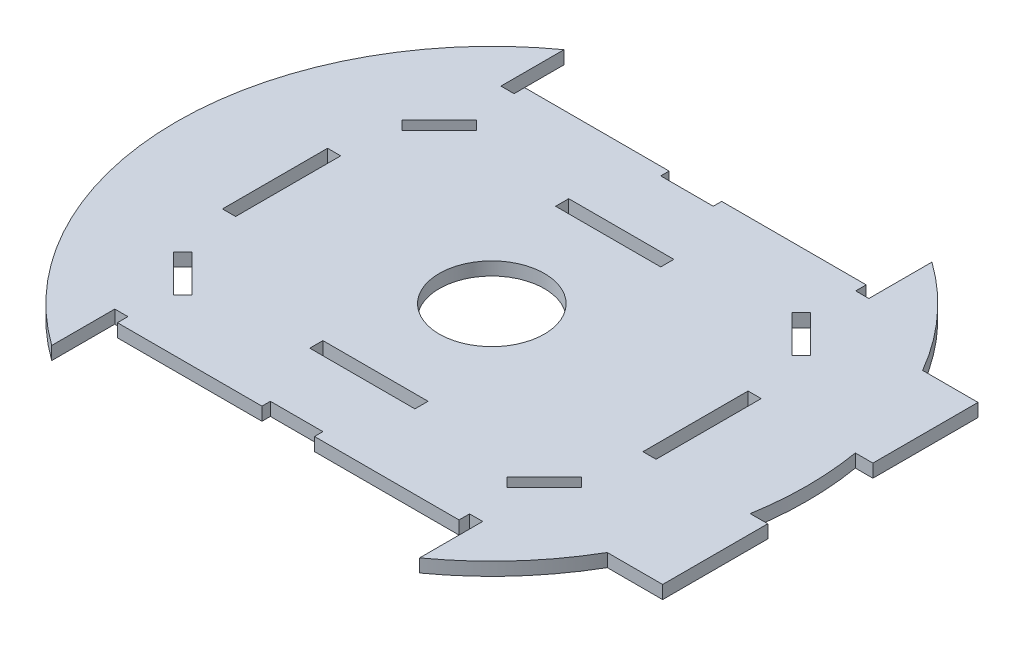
ISO-10303-21;
HEADER;
FILE_DESCRIPTION(('STEP AP214'),'2;1');
FILE_NAME('part.step','',(''),(''),'','','');
FILE_SCHEMA(('AUTOMOTIVE_DESIGN { 1 0 10303 214 1 1 1 1 }'));
ENDSEC;
DATA;
#1=APPLICATION_CONTEXT('core data for automotive mechanical design processes');
#2=APPLICATION_PROTOCOL_DEFINITION('international standard','automotive_design',2000,#1);
#3=PRODUCT_CONTEXT('',#1,'mechanical');
#4=PRODUCT('Part','Part','',(#3));
#5=PRODUCT_RELATED_PRODUCT_CATEGORY('part','',(#4));
#6=PRODUCT_DEFINITION_FORMATION('','',#4);
#7=PRODUCT_DEFINITION_CONTEXT('part definition',#1,'design');
#8=PRODUCT_DEFINITION('design','',#6,#7);
#9=PRODUCT_DEFINITION_SHAPE('','',#8);
#10=(LENGTH_UNIT() NAMED_UNIT(*) SI_UNIT(.MILLI.,.METRE.));
#11=(NAMED_UNIT(*) PLANE_ANGLE_UNIT() SI_UNIT($,.RADIAN.));
#12=(NAMED_UNIT(*) SI_UNIT($,.STERADIAN.) SOLID_ANGLE_UNIT());
#13=UNCERTAINTY_MEASURE_WITH_UNIT(LENGTH_MEASURE(1.E-05),#10,'distance_accuracy_value','');
#14=(GEOMETRIC_REPRESENTATION_CONTEXT(3) GLOBAL_UNCERTAINTY_ASSIGNED_CONTEXT((#13)) GLOBAL_UNIT_ASSIGNED_CONTEXT((#10,
#11,#12)) REPRESENTATION_CONTEXT('',''));
#15=CARTESIAN_POINT('',(0.,0.,0.));
#16=DIRECTION('',(0.,0.,1.));
#17=DIRECTION('',(1.,0.,0.));
#18=AXIS2_PLACEMENT_3D('',#15,#16,#17);
#19=CARTESIAN_POINT('',(0.,1.5875,0.));
#20=DIRECTION('',(0.,-1.,0.));
#21=DIRECTION('',(0.,0.,-1.));
#22=AXIS2_PLACEMENT_3D('',#19,#20,#21);
#23=CYLINDRICAL_SURFACE('',#22,76.2);
#24=CARTESIAN_POINT('',(0.,-1.5875,0.));
#25=DIRECTION('',(0.,1.,0.));
#26=DIRECTION('',(0.,0.,1.));
#27=AXIS2_PLACEMENT_3D('',#24,#25,#26);
#28=CIRCLE('',#27,76.2);
#29=CARTESIAN_POINT('',(75.1342132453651,-1.5875,12.7));
#30=VERTEX_POINT('',#29);
#31=CARTESIAN_POINT('',(75.1342132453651,-1.5875,-12.7));
#32=VERTEX_POINT('',#31);
#33=EDGE_CURVE('E462',#30,#32,#28,.T.);
#34=ORIENTED_EDGE('',*,*,#33,.T.);
#35=DIRECTION('',(0.,-1.,0.));
#36=VECTOR('',#35,1.);
#37=CARTESIAN_POINT('',(75.1342132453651,1.5875,-12.7));
#38=LINE('',#37,#36);
#39=CARTESIAN_POINT('',(75.1342132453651,1.5875,-12.7));
#40=VERTEX_POINT('',#39);
#41=EDGE_CURVE('E485',#32,#40,#38,.F.);
#42=ORIENTED_EDGE('',*,*,#41,.T.);
#43=CARTESIAN_POINT('',(0.,1.5875,0.));
#44=DIRECTION('',(0.,1.,0.));
#45=DIRECTION('',(0.,0.,1.));
#46=AXIS2_PLACEMENT_3D('',#43,#44,#45);
#47=CIRCLE('',#46,76.2);
#48=CARTESIAN_POINT('',(75.1342132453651,1.5875,12.7));
#49=VERTEX_POINT('',#48);
#50=EDGE_CURVE('E40',#49,#40,#47,.T.);
#51=ORIENTED_EDGE('',*,*,#50,.F.);
#52=DIRECTION('',(0.,-1.,0.));
#53=VECTOR('',#52,1.);
#54=CARTESIAN_POINT('',(75.1342132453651,1.5875,12.7));
#55=LINE('',#54,#53);
#56=EDGE_CURVE('E483',#49,#30,#55,.T.);
#57=ORIENTED_EDGE('',*,*,#56,.T.);
#58=EDGE_LOOP('',(#34,#42,#51,#57));
#59=FACE_BOUND('',#58,.T.);
#60=ADVANCED_FACE('F31',(#59),#23,.T.);
#61=CARTESIAN_POINT('',(65.9911357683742,1.5875,-38.1));
#62=VERTEX_POINT('',#61);
#63=CARTESIAN_POINT('',(44.45,1.5875,-61.8921440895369));
#64=VERTEX_POINT('',#63);
#65=EDGE_CURVE('E41',#62,#64,#47,.T.);
#66=ORIENTED_EDGE('',*,*,#65,.F.);
#67=DIRECTION('',(0.,1.,0.));
#68=VECTOR('',#67,1.);
#69=CARTESIAN_POINT('',(65.9911357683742,-1.5875,-38.1));
#70=LINE('',#69,#68);
#71=CARTESIAN_POINT('',(65.9911357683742,-1.5875,-38.1));
#72=VERTEX_POINT('',#71);
#73=EDGE_CURVE('E439',#72,#62,#70,.T.);
#74=ORIENTED_EDGE('',*,*,#73,.F.);
#75=CARTESIAN_POINT('',(44.45,-1.5875,-61.8921440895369));
#76=VERTEX_POINT('',#75);
#77=EDGE_CURVE('E452',#72,#76,#28,.T.);
#78=ORIENTED_EDGE('',*,*,#77,.T.);
#79=DIRECTION('',(0.,1.,0.));
#80=VECTOR('',#79,1.);
#81=CARTESIAN_POINT('',(44.45,-1.5875,-61.8921440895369));
#82=LINE('',#81,#80);
#83=EDGE_CURVE('E847',#76,#64,#82,.T.);
#84=ORIENTED_EDGE('',*,*,#83,.T.);
#85=EDGE_LOOP('',(#66,#74,#78,#84));
#86=FACE_BOUND('',#85,.T.);
#87=ADVANCED_FACE('F450',(#86),#23,.T.);
#88=CARTESIAN_POINT('',(0.,-1.5875,-49.1921440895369));
#89=DIRECTION('',(0.,0.,1.));
#90=DIRECTION('',(1.,0.,0.));
#91=AXIS2_PLACEMENT_3D('',#88,#89,#90);
#92=PLANE('',#91);
#93=DIRECTION('',(1.,0.,0.));
#94=VECTOR('',#93,1.);
#95=CARTESIAN_POINT('',(0.,1.5875,-49.1921440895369));
#96=LINE('',#95,#94);
#97=CARTESIAN_POINT('',(6.35,1.5875,-49.1921440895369));
#98=VERTEX_POINT('',#97);
#99=CARTESIAN_POINT('',(41.2749999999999,1.5875,-49.1921440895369));
#100=VERTEX_POINT('',#99);
#101=EDGE_CURVE('E834',#98,#100,#96,.T.);
#102=ORIENTED_EDGE('',*,*,#101,.T.);
#103=DIRECTION('',(0.,1.,0.));
#104=VECTOR('',#103,1.);
#105=CARTESIAN_POINT('',(41.2749999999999,-1.5875,-49.1921440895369));
#106=LINE('',#105,#104);
#107=CARTESIAN_POINT('',(41.2749999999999,-1.5875,-49.1921440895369));
#108=VERTEX_POINT('',#107);
#109=EDGE_CURVE('E545',#108,#100,#106,.T.);
#110=ORIENTED_EDGE('',*,*,#109,.F.);
#111=DIRECTION('',(1.,0.,0.));
#112=VECTOR('',#111,1.);
#113=CARTESIAN_POINT('',(-44.45,-1.5875,-49.1921440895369));
#114=LINE('',#113,#112);
#115=CARTESIAN_POINT('',(6.35,-1.5875,-49.1921440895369));
#116=VERTEX_POINT('',#115);
#117=EDGE_CURVE('E843',#116,#108,#114,.T.);
#118=ORIENTED_EDGE('',*,*,#117,.F.);
#119=DIRECTION('',(0.,1.,0.));
#120=VECTOR('',#119,1.);
#121=CARTESIAN_POINT('',(6.35,-1.5875,-49.1921440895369));
#122=LINE('',#121,#120);
#123=EDGE_CURVE('E797',#116,#98,#122,.T.);
#124=ORIENTED_EDGE('',*,*,#123,.T.);
#125=EDGE_LOOP('',(#102,#110,#118,#124));
#126=FACE_BOUND('',#125,.T.);
#127=ADVANCED_FACE('F971',(#126),#92,.F.);
#128=CARTESIAN_POINT('',(-44.45,-1.5875,49.1921440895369));
#129=DIRECTION('',(0.,0.,-1.));
#130=DIRECTION('',(-1.,0.,0.));
#131=AXIS2_PLACEMENT_3D('',#128,#129,#130);
#132=PLANE('',#131);
#133=DIRECTION('',(-1.,0.,0.));
#134=VECTOR('',#133,1.);
#135=CARTESIAN_POINT('',(-44.45,1.5875,49.1921440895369));
#136=LINE('',#135,#134);
#137=CARTESIAN_POINT('',(-6.35,1.5875,49.1921440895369));
#138=VERTEX_POINT('',#137);
#139=CARTESIAN_POINT('',(-41.275,1.5875,49.1921440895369));
#140=VERTEX_POINT('',#139);
#141=EDGE_CURVE('E870',#138,#140,#136,.T.);
#142=ORIENTED_EDGE('',*,*,#141,.T.);
#143=DIRECTION('',(0.,1.,0.));
#144=VECTOR('',#143,1.);
#145=CARTESIAN_POINT('',(-41.275,-1.5875,49.1921440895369));
#146=LINE('',#145,#144);
#147=CARTESIAN_POINT('',(-41.275,-1.5875,49.1921440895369));
#148=VERTEX_POINT('',#147);
#149=EDGE_CURVE('E583',#148,#140,#146,.T.);
#150=ORIENTED_EDGE('',*,*,#149,.F.);
#151=DIRECTION('',(-1.,0.,0.));
#152=VECTOR('',#151,1.);
#153=CARTESIAN_POINT('',(0.,-1.5875,49.1921440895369));
#154=LINE('',#153,#152);
#155=CARTESIAN_POINT('',(-6.35,-1.5875,49.1921440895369));
#156=VERTEX_POINT('',#155);
#157=EDGE_CURVE('E861',#156,#148,#154,.T.);
#158=ORIENTED_EDGE('',*,*,#157,.F.);
#159=DIRECTION('',(0.,1.,0.));
#160=VECTOR('',#159,1.);
#161=CARTESIAN_POINT('',(-6.35,-1.5875,49.1921440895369));
#162=LINE('',#161,#160);
#163=EDGE_CURVE('E831',#156,#138,#162,.T.);
#164=ORIENTED_EDGE('',*,*,#163,.T.);
#165=EDGE_LOOP('',(#142,#150,#158,#164));
#166=FACE_BOUND('',#165,.T.);
#167=ADVANCED_FACE('F980',(#166),#132,.F.);
#168=CARTESIAN_POINT('',(-44.45,1.5875,-61.8921440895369));
#169=VERTEX_POINT('',#168);
#170=CARTESIAN_POINT('',(-44.45,1.5875,61.8921440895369));
#171=VERTEX_POINT('',#170);
#172=EDGE_CURVE('E42',#169,#171,#47,.T.);
#173=ORIENTED_EDGE('',*,*,#172,.F.);
#174=DIRECTION('',(0.,1.,0.));
#175=VECTOR('',#174,1.);
#176=CARTESIAN_POINT('',(-44.45,-1.5875,-61.8921440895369));
#177=LINE('',#176,#175);
#178=CARTESIAN_POINT('',(-44.45,-1.5875,-61.8921440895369));
#179=VERTEX_POINT('',#178);
#180=EDGE_CURVE('E855',#179,#169,#177,.T.);
#181=ORIENTED_EDGE('',*,*,#180,.F.);
#182=CARTESIAN_POINT('',(-44.45,-1.5875,61.8921440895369));
#183=VERTEX_POINT('',#182);
#184=EDGE_CURVE('E463',#179,#183,#28,.T.);
#185=ORIENTED_EDGE('',*,*,#184,.T.);
#186=DIRECTION('',(0.,1.,0.));
#187=VECTOR('',#186,1.);
#188=CARTESIAN_POINT('',(-44.45,-1.5875,61.8921440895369));
#189=LINE('',#188,#187);
#190=EDGE_CURVE('E874',#183,#171,#189,.T.);
#191=ORIENTED_EDGE('',*,*,#190,.T.);
#192=EDGE_LOOP('',(#173,#181,#185,#191));
#193=FACE_BOUND('',#192,.T.);
#194=ADVANCED_FACE('F972',(#193),#23,.T.);
#195=CARTESIAN_POINT('',(44.45,-1.5875,61.8921440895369));
#196=VERTEX_POINT('',#195);
#197=CARTESIAN_POINT('',(65.9911357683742,-1.5875,38.1));
#198=VERTEX_POINT('',#197);
#199=EDGE_CURVE('E35',#196,#198,#28,.T.);
#200=ORIENTED_EDGE('',*,*,#199,.T.);
#201=DIRECTION('',(0.,1.,0.));
#202=VECTOR('',#201,1.);
#203=CARTESIAN_POINT('',(65.9911357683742,-1.5875,38.1));
#204=LINE('',#203,#202);
#205=CARTESIAN_POINT('',(65.9911357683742,1.5875,38.1));
#206=VERTEX_POINT('',#205);
#207=EDGE_CURVE('E503',#198,#206,#204,.T.);
#208=ORIENTED_EDGE('',*,*,#207,.T.);
#209=CARTESIAN_POINT('',(44.45,1.5875,61.8921440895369));
#210=VERTEX_POINT('',#209);
#211=EDGE_CURVE('E11',#210,#206,#47,.T.);
#212=ORIENTED_EDGE('',*,*,#211,.F.);
#213=DIRECTION('',(0.,1.,0.));
#214=VECTOR('',#213,1.);
#215=CARTESIAN_POINT('',(44.45,-1.5875,61.8921440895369));
#216=LINE('',#215,#214);
#217=EDGE_CURVE('E868',#196,#210,#216,.T.);
#218=ORIENTED_EDGE('',*,*,#217,.F.);
#219=EDGE_LOOP('',(#200,#208,#212,#218));
#220=FACE_BOUND('',#219,.T.);
#221=ADVANCED_FACE('F33',(#220),#23,.T.);
#222=CARTESIAN_POINT('',(0.,1.5875,0.));
#223=DIRECTION('',(0.,1.,0.));
#224=DIRECTION('',(0.,0.,1.));
#225=AXIS2_PLACEMENT_3D('',#222,#223,#224);
#226=PLANE('',#225);
#227=ORIENTED_EDGE('',*,*,#50,.T.);
#228=DIRECTION('',(1.,0.,0.));
#229=VECTOR('',#228,1.);
#230=CARTESIAN_POINT('',(65.9911357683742,1.5875,-12.7));
#231=LINE('',#230,#229);
#232=CARTESIAN_POINT('',(79.375,1.5875,-12.7));
#233=VERTEX_POINT('',#232);
#234=EDGE_CURVE('E478',#40,#233,#231,.T.);
#235=ORIENTED_EDGE('',*,*,#234,.T.);
#236=DIRECTION('',(0.,0.,-1.));
#237=VECTOR('',#236,1.);
#238=CARTESIAN_POINT('',(79.375,1.5875,-38.1));
#239=LINE('',#238,#237);
#240=CARTESIAN_POINT('',(79.375,1.5875,-38.1));
#241=VERTEX_POINT('',#240);
#242=EDGE_CURVE('E447',#233,#241,#239,.T.);
#243=ORIENTED_EDGE('',*,*,#242,.T.);
#244=DIRECTION('',(-1.,0.,0.));
#245=VECTOR('',#244,1.);
#246=CARTESIAN_POINT('',(65.9911357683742,1.5875,-38.1));
#247=LINE('',#246,#245);
#248=EDGE_CURVE('E49',#241,#62,#247,.T.);
#249=ORIENTED_EDGE('',*,*,#248,.T.);
#250=ORIENTED_EDGE('',*,*,#65,.T.);
#251=DIRECTION('',(0.,0.,-1.));
#252=VECTOR('',#251,1.);
#253=CARTESIAN_POINT('',(44.45,1.5875,-49.1921440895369));
#254=LINE('',#253,#252);
#255=CARTESIAN_POINT('',(44.45,1.5875,-46.6521440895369));
#256=VERTEX_POINT('',#255);
#257=EDGE_CURVE('E850',#256,#64,#254,.T.);
#258=ORIENTED_EDGE('',*,*,#257,.F.);
#259=DIRECTION('',(1.,0.,0.));
#260=VECTOR('',#259,1.);
#261=CARTESIAN_POINT('',(44.45,1.5875,-46.6521440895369));
#262=LINE('',#261,#260);
#263=CARTESIAN_POINT('',(41.275,1.5875,-46.6521440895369));
#264=VERTEX_POINT('',#263);
#265=EDGE_CURVE('E543',#264,#256,#262,.T.);
#266=ORIENTED_EDGE('',*,*,#265,.F.);
#267=DIRECTION('',(0.,0.,1.));
#268=VECTOR('',#267,1.);
#269=CARTESIAN_POINT('',(41.2749999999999,1.5875,-49.1921440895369));
#270=LINE('',#269,#268);
#271=EDGE_CURVE('E534',#100,#264,#270,.T.);
#272=ORIENTED_EDGE('',*,*,#271,.F.);
#273=ORIENTED_EDGE('',*,*,#101,.F.);
#274=DIRECTION('',(0.,0.,-1.));
#275=VECTOR('',#274,1.);
#276=CARTESIAN_POINT('',(6.35,1.5875,-47.1601440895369));
#277=LINE('',#276,#275);
#278=CARTESIAN_POINT('',(6.35,1.5875,-47.1601440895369));
#279=VERTEX_POINT('',#278);
#280=EDGE_CURVE('E780',#279,#98,#277,.T.);
#281=ORIENTED_EDGE('',*,*,#280,.F.);
#282=DIRECTION('',(1.,0.,0.));
#283=VECTOR('',#282,1.);
#284=CARTESIAN_POINT('',(0.,1.5875,-47.1601440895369));
#285=LINE('',#284,#283);
#286=CARTESIAN_POINT('',(-6.35,1.5875,-47.1601440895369));
#287=VERTEX_POINT('',#286);
#288=EDGE_CURVE('E791',#287,#279,#285,.T.);
#289=ORIENTED_EDGE('',*,*,#288,.F.);
#290=DIRECTION('',(0.,0.,1.));
#291=VECTOR('',#290,1.);
#292=CARTESIAN_POINT('',(-6.35,1.5875,-49.1921440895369));
#293=LINE('',#292,#291);
#294=CARTESIAN_POINT('',(-6.35,1.5875,-49.1921440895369));
#295=VERTEX_POINT('',#294);
#296=EDGE_CURVE('E799',#295,#287,#293,.T.);
#297=ORIENTED_EDGE('',*,*,#296,.F.);
#298=CARTESIAN_POINT('',(-41.275,1.5875,-49.1921440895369));
#299=VERTEX_POINT('',#298);
#300=EDGE_CURVE('E848',#299,#295,#96,.T.);
#301=ORIENTED_EDGE('',*,*,#300,.F.);
#302=DIRECTION('',(0.,0.,-1.));
#303=VECTOR('',#302,1.);
#304=CARTESIAN_POINT('',(-41.275,1.5875,-49.1921440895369));
#305=LINE('',#304,#303);
#306=CARTESIAN_POINT('',(-41.275,1.5875,-46.6521440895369));
#307=VERTEX_POINT('',#306);
#308=EDGE_CURVE('E524',#307,#299,#305,.T.);
#309=ORIENTED_EDGE('',*,*,#308,.F.);
#310=DIRECTION('',(1.,0.,0.));
#311=VECTOR('',#310,1.);
#312=CARTESIAN_POINT('',(-44.45,1.5875,-46.6521440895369));
#313=LINE('',#312,#311);
#314=CARTESIAN_POINT('',(-44.45,1.5875,-46.6521440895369));
#315=VERTEX_POINT('',#314);
#316=EDGE_CURVE('E517',#315,#307,#313,.T.);
#317=ORIENTED_EDGE('',*,*,#316,.F.);
#318=DIRECTION('',(0.,0.,1.));
#319=VECTOR('',#318,1.);
#320=CARTESIAN_POINT('',(-44.45,1.5875,-61.8921440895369));
#321=LINE('',#320,#319);
#322=EDGE_CURVE('E853',#169,#315,#321,.T.);
#323=ORIENTED_EDGE('',*,*,#322,.F.);
#324=ORIENTED_EDGE('',*,*,#172,.T.);
#325=DIRECTION('',(0.,0.,1.));
#326=VECTOR('',#325,1.);
#327=CARTESIAN_POINT('',(-44.45,1.5875,61.8921440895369));
#328=LINE('',#327,#326);
#329=CARTESIAN_POINT('',(-44.45,1.5875,46.6521440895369));
#330=VERTEX_POINT('',#329);
#331=EDGE_CURVE('E862',#330,#171,#328,.T.);
#332=ORIENTED_EDGE('',*,*,#331,.F.);
#333=DIRECTION('',(-1.,0.,0.));
#334=VECTOR('',#333,1.);
#335=CARTESIAN_POINT('',(-44.45,1.5875,46.6521440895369));
#336=LINE('',#335,#334);
#337=CARTESIAN_POINT('',(-41.275,1.5875,46.6521440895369));
#338=VERTEX_POINT('',#337);
#339=EDGE_CURVE('E580',#338,#330,#336,.T.);
#340=ORIENTED_EDGE('',*,*,#339,.F.);
#341=DIRECTION('',(0.,0.,-1.));
#342=VECTOR('',#341,1.);
#343=CARTESIAN_POINT('',(-41.275,1.5875,49.1921440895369));
#344=LINE('',#343,#342);
#345=EDGE_CURVE('E571',#140,#338,#344,.T.);
#346=ORIENTED_EDGE('',*,*,#345,.F.);
#347=ORIENTED_EDGE('',*,*,#141,.F.);
#348=DIRECTION('',(0.,0.,1.));
#349=VECTOR('',#348,1.);
#350=CARTESIAN_POINT('',(-6.35,1.5875,49.1921440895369));
#351=LINE('',#350,#349);
#352=CARTESIAN_POINT('',(-6.35,1.5875,47.1601440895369));
#353=VERTEX_POINT('',#352);
#354=EDGE_CURVE('E818',#353,#138,#351,.T.);
#355=ORIENTED_EDGE('',*,*,#354,.F.);
#356=DIRECTION('',(-1.,0.,0.));
#357=VECTOR('',#356,1.);
#358=CARTESIAN_POINT('',(-6.35,1.5875,47.1601440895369));
#359=LINE('',#358,#357);
#360=CARTESIAN_POINT('',(6.35,1.5875,47.1601440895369));
#361=VERTEX_POINT('',#360);
#362=EDGE_CURVE('E827',#361,#353,#359,.T.);
#363=ORIENTED_EDGE('',*,*,#362,.F.);
#364=DIRECTION('',(0.,0.,-1.));
#365=VECTOR('',#364,1.);
#366=CARTESIAN_POINT('',(6.35,1.5875,47.1601440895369));
#367=LINE('',#366,#365);
#368=CARTESIAN_POINT('',(6.35,1.5875,49.1921440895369));
#369=VERTEX_POINT('',#368);
#370=EDGE_CURVE('E806',#369,#361,#367,.T.);
#371=ORIENTED_EDGE('',*,*,#370,.F.);
#372=CARTESIAN_POINT('',(41.275,1.5875,49.1921440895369));
#373=VERTEX_POINT('',#372);
#374=EDGE_CURVE('E871',#373,#369,#136,.T.);
#375=ORIENTED_EDGE('',*,*,#374,.F.);
#376=DIRECTION('',(0.,0.,1.));
#377=VECTOR('',#376,1.);
#378=CARTESIAN_POINT('',(41.275,1.5875,49.1921440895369));
#379=LINE('',#378,#377);
#380=CARTESIAN_POINT('',(41.275,1.5875,46.6521440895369));
#381=VERTEX_POINT('',#380);
#382=EDGE_CURVE('E561',#381,#373,#379,.T.);
#383=ORIENTED_EDGE('',*,*,#382,.F.);
#384=DIRECTION('',(-1.,0.,0.));
#385=VECTOR('',#384,1.);
#386=CARTESIAN_POINT('',(44.45,1.5875,46.6521440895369));
#387=LINE('',#386,#385);
#388=CARTESIAN_POINT('',(44.45,1.5875,46.6521440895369));
#389=VERTEX_POINT('',#388);
#390=EDGE_CURVE('E553',#389,#381,#387,.T.);
#391=ORIENTED_EDGE('',*,*,#390,.F.);
#392=DIRECTION('',(0.,0.,-1.));
#393=VECTOR('',#392,1.);
#394=CARTESIAN_POINT('',(44.45,1.5875,49.1921440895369));
#395=LINE('',#394,#393);
#396=EDGE_CURVE('E857',#210,#389,#395,.T.);
#397=ORIENTED_EDGE('',*,*,#396,.F.);
#398=ORIENTED_EDGE('',*,*,#211,.T.);
#399=DIRECTION('',(1.,0.,0.));
#400=VECTOR('',#399,1.);
#401=CARTESIAN_POINT('',(65.9911357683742,1.5875,38.1));
#402=LINE('',#401,#400);
#403=CARTESIAN_POINT('',(79.375,1.5875,38.1));
#404=VERTEX_POINT('',#403);
#405=EDGE_CURVE('E488',#206,#404,#402,.T.);
#406=ORIENTED_EDGE('',*,*,#405,.T.);
#407=DIRECTION('',(0.,0.,-1.));
#408=VECTOR('',#407,1.);
#409=CARTESIAN_POINT('',(79.375,1.5875,38.1));
#410=LINE('',#409,#408);
#411=CARTESIAN_POINT('',(79.375,1.5875,12.7));
#412=VERTEX_POINT('',#411);
#413=EDGE_CURVE('E491',#404,#412,#410,.T.);
#414=ORIENTED_EDGE('',*,*,#413,.T.);
#415=DIRECTION('',(-1.,0.,0.));
#416=VECTOR('',#415,1.);
#417=CARTESIAN_POINT('',(65.9911357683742,1.5875,12.7));
#418=LINE('',#417,#416);
#419=EDGE_CURVE('E56',#412,#49,#418,.T.);
#420=ORIENTED_EDGE('',*,*,#419,.T.);
#421=EDGE_LOOP('',(#227,#235,#243,#249,#250,#258,#266,#272,#273,#281,#289,#297,#301,#309,#317,
#323,#324,#332,#340,#346,#347,#355,#363,#371,#375,#383,#391,#397,#398,#406,#414,#420));
#422=FACE_BOUND('',#421,.T.);
#423=CARTESIAN_POINT('',(0.,1.5875,0.));
#424=DIRECTION('',(0.,1.,0.));
#425=DIRECTION('',(0.,0.,1.));
#426=AXIS2_PLACEMENT_3D('',#423,#424,#425);
#427=CIRCLE('',#426,12.7);
#428=CARTESIAN_POINT('',(0.,1.5875,12.7));
#429=VERTEX_POINT('',#428);
#430=EDGE_CURVE('E513',#429,#429,#427,.T.);
#431=ORIENTED_EDGE('',*,*,#430,.F.);
#432=EDGE_LOOP('',(#431));
#433=FACE_BOUND('',#432,.T.);
#434=DIRECTION('',(0.707106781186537,0.,-0.707106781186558));
#435=VECTOR('',#434,1.);
#436=CARTESIAN_POINT('',(-40.3450640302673,1.5875,36.6253201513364));
#437=LINE('',#436,#435);
#438=CARTESIAN_POINT('',(-40.3450640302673,1.5875,36.6253201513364));
#439=VERTEX_POINT('',#438);
#440=CARTESIAN_POINT('',(-38.1,1.5875,34.3802561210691));
#441=VERTEX_POINT('',#440);
#442=EDGE_CURVE('E591',#439,#441,#437,.T.);
#443=ORIENTED_EDGE('',*,*,#442,.F.);
#444=DIRECTION('',(0.707106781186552,0.,0.707106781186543));
#445=VECTOR('',#444,1.);
#446=CARTESIAN_POINT('',(-40.3450640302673,1.5875,36.6253201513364));
#447=LINE('',#446,#445);
#448=CARTESIAN_POINT('',(-49.3253201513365,1.5875,27.6450640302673));
#449=VERTEX_POINT('',#448);
#450=EDGE_CURVE('E599',#449,#439,#447,.T.);
#451=ORIENTED_EDGE('',*,*,#450,.F.);
#452=DIRECTION('',(-0.707106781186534,0.,0.707106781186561));
#453=VECTOR('',#452,1.);
#454=CARTESIAN_POINT('',(-49.3253201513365,1.5875,27.6450640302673));
#455=LINE('',#454,#453);
#456=CARTESIAN_POINT('',(-47.0802561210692,1.5875,25.4));
#457=VERTEX_POINT('',#456);
#458=EDGE_CURVE('E613',#457,#449,#455,.T.);
#459=ORIENTED_EDGE('',*,*,#458,.F.);
#460=DIRECTION('',(-0.707106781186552,0.,-0.707106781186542));
#461=VECTOR('',#460,1.);
#462=CARTESIAN_POINT('',(-38.1,1.5875,34.3802561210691));
#463=LINE('',#462,#461);
#464=EDGE_CURVE('E610',#441,#457,#463,.T.);
#465=ORIENTED_EDGE('',*,*,#464,.F.);
#466=EDGE_LOOP('',(#443,#451,#459,#465));
#467=FACE_BOUND('',#466,.T.);
#468=DIRECTION('',(0.707106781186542,0.,0.707106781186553));
#469=VECTOR('',#468,1.);
#470=CARTESIAN_POINT('',(40.3450640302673,1.5875,36.6253201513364));
#471=LINE('',#470,#469);
#472=CARTESIAN_POINT('',(38.1,1.5875,34.3802561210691));
#473=VERTEX_POINT('',#472);
#474=CARTESIAN_POINT('',(40.3450640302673,1.5875,36.6253201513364));
#475=VERTEX_POINT('',#474);
#476=EDGE_CURVE('E620',#473,#475,#471,.T.);
#477=ORIENTED_EDGE('',*,*,#476,.F.);
#478=DIRECTION('',(-0.707106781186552,0.,0.707106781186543));
#479=VECTOR('',#478,1.);
#480=CARTESIAN_POINT('',(38.1,1.5875,34.3802561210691));
#481=LINE('',#480,#479);
#482=CARTESIAN_POINT('',(47.0802561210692,1.5875,25.4));
#483=VERTEX_POINT('',#482);
#484=EDGE_CURVE('E631',#483,#473,#481,.T.);
#485=ORIENTED_EDGE('',*,*,#484,.F.);
#486=DIRECTION('',(-0.707106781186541,0.,-0.707106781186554));
#487=VECTOR('',#486,1.);
#488=CARTESIAN_POINT('',(49.3253201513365,1.5875,27.6450640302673));
#489=LINE('',#488,#487);
#490=CARTESIAN_POINT('',(49.3253201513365,1.5875,27.6450640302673));
#491=VERTEX_POINT('',#490);
#492=EDGE_CURVE('E645',#491,#483,#489,.T.);
#493=ORIENTED_EDGE('',*,*,#492,.F.);
#494=DIRECTION('',(0.707106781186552,0.,-0.707106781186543));
#495=VECTOR('',#494,1.);
#496=CARTESIAN_POINT('',(40.3450640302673,1.5875,36.6253201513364));
#497=LINE('',#496,#495);
#498=EDGE_CURVE('E642',#475,#491,#497,.T.);
#499=ORIENTED_EDGE('',*,*,#498,.F.);
#500=EDGE_LOOP('',(#477,#485,#493,#499));
#501=FACE_BOUND('',#500,.T.);
#502=DIRECTION('',(-0.707106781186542,0.,0.707106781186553));
#503=VECTOR('',#502,1.);
#504=CARTESIAN_POINT('',(40.3450640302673,1.5875,-36.6253201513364));
#505=LINE('',#504,#503);
#506=CARTESIAN_POINT('',(40.3450640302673,1.5875,-36.6253201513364));
#507=VERTEX_POINT('',#506);
#508=CARTESIAN_POINT('',(38.1,1.5875,-34.3802561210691));
#509=VERTEX_POINT('',#508);
#510=EDGE_CURVE('E652',#507,#509,#505,.T.);
#511=ORIENTED_EDGE('',*,*,#510,.F.);
#512=DIRECTION('',(-0.707106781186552,0.,-0.707106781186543));
#513=VECTOR('',#512,1.);
#514=CARTESIAN_POINT('',(40.3450640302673,1.5875,-36.6253201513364));
#515=LINE('',#514,#513);
#516=CARTESIAN_POINT('',(49.3253201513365,1.5875,-27.6450640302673));
#517=VERTEX_POINT('',#516);
#518=EDGE_CURVE('E663',#517,#507,#515,.T.);
#519=ORIENTED_EDGE('',*,*,#518,.F.);
#520=DIRECTION('',(0.707106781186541,0.,-0.707106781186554));
#521=VECTOR('',#520,1.);
#522=CARTESIAN_POINT('',(49.3253201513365,1.5875,-27.6450640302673));
#523=LINE('',#522,#521);
#524=CARTESIAN_POINT('',(47.0802561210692,1.5875,-25.4));
#525=VERTEX_POINT('',#524);
#526=EDGE_CURVE('E677',#525,#517,#523,.T.);
#527=ORIENTED_EDGE('',*,*,#526,.F.);
#528=DIRECTION('',(0.707106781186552,0.,0.707106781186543));
#529=VECTOR('',#528,1.);
#530=CARTESIAN_POINT('',(38.1,1.5875,-34.3802561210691));
#531=LINE('',#530,#529);
#532=EDGE_CURVE('E674',#509,#525,#531,.T.);
#533=ORIENTED_EDGE('',*,*,#532,.F.);
#534=EDGE_LOOP('',(#511,#519,#527,#533));
#535=FACE_BOUND('',#534,.T.);
#536=DIRECTION('',(-0.707106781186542,0.,-0.707106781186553));
#537=VECTOR('',#536,1.);
#538=CARTESIAN_POINT('',(-40.3450640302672,1.5875,-36.6253201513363));
#539=LINE('',#538,#537);
#540=CARTESIAN_POINT('',(-38.1,1.5875,-34.3802561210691));
#541=VERTEX_POINT('',#540);
#542=CARTESIAN_POINT('',(-40.3450640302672,1.5875,-36.6253201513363));
#543=VERTEX_POINT('',#542);
#544=EDGE_CURVE('E684',#541,#543,#539,.T.);
#545=ORIENTED_EDGE('',*,*,#544,.F.);
#546=DIRECTION('',(0.707106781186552,0.,-0.707106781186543));
#547=VECTOR('',#546,1.);
#548=CARTESIAN_POINT('',(-38.1,1.5875,-34.3802561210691));
#549=LINE('',#548,#547);
#550=CARTESIAN_POINT('',(-47.0802561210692,1.5875,-25.4));
#551=VERTEX_POINT('',#550);
#552=EDGE_CURVE('E695',#551,#541,#549,.T.);
#553=ORIENTED_EDGE('',*,*,#552,.F.);
#554=DIRECTION('',(0.707106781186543,0.,0.707106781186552));
#555=VECTOR('',#554,1.);
#556=CARTESIAN_POINT('',(-49.3253201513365,1.5875,-27.6450640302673));
#557=LINE('',#556,#555);
#558=CARTESIAN_POINT('',(-49.3253201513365,1.5875,-27.6450640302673));
#559=VERTEX_POINT('',#558);
#560=EDGE_CURVE('E709',#559,#551,#557,.T.);
#561=ORIENTED_EDGE('',*,*,#560,.F.);
#562=DIRECTION('',(-0.70710678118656,0.,0.707106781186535));
#563=VECTOR('',#562,1.);
#564=CARTESIAN_POINT('',(-40.3450640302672,1.5875,-36.6253201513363));
#565=LINE('',#564,#563);
#566=EDGE_CURVE('E706',#543,#559,#565,.T.);
#567=ORIENTED_EDGE('',*,*,#566,.F.);
#568=EDGE_LOOP('',(#545,#553,#561,#567));
#569=FACE_BOUND('',#568,.T.);
#570=DIRECTION('',(0.,0.,1.));
#571=VECTOR('',#570,1.);
#572=CARTESIAN_POINT('',(-12.7,1.5875,-28.1101440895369));
#573=LINE('',#572,#571);
#574=CARTESIAN_POINT('',(-12.7,1.5875,-31.2851440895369));
#575=VERTEX_POINT('',#574);
#576=CARTESIAN_POINT('',(-12.7,1.5875,-28.1101440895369));
#577=VERTEX_POINT('',#576);
#578=EDGE_CURVE('E716',#575,#577,#573,.T.);
#579=ORIENTED_EDGE('',*,*,#578,.F.);
#580=DIRECTION('',(-1.,0.,0.));
#581=VECTOR('',#580,1.);
#582=CARTESIAN_POINT('',(-12.7,1.5875,-31.2851440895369));
#583=LINE('',#582,#581);
#584=CARTESIAN_POINT('',(12.7,1.5875,-31.2851440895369));
#585=VERTEX_POINT('',#584);
#586=EDGE_CURVE('E727',#585,#575,#583,.T.);
#587=ORIENTED_EDGE('',*,*,#586,.F.);
#588=DIRECTION('',(0.,0.,-1.));
#589=VECTOR('',#588,1.);
#590=CARTESIAN_POINT('',(12.7,1.5875,-28.1101440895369));
#591=LINE('',#590,#589);
#592=CARTESIAN_POINT('',(12.7,1.5875,-28.1101440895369));
#593=VERTEX_POINT('',#592);
#594=EDGE_CURVE('E741',#593,#585,#591,.T.);
#595=ORIENTED_EDGE('',*,*,#594,.F.);
#596=DIRECTION('',(1.,0.,0.));
#597=VECTOR('',#596,1.);
#598=CARTESIAN_POINT('',(-12.7,1.5875,-28.1101440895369));
#599=LINE('',#598,#597);
#600=EDGE_CURVE('E738',#577,#593,#599,.T.);
#601=ORIENTED_EDGE('',*,*,#600,.F.);
#602=EDGE_LOOP('',(#579,#587,#595,#601));
#603=FACE_BOUND('',#602,.T.);
#604=DIRECTION('',(0.,0.,-1.));
#605=VECTOR('',#604,1.);
#606=CARTESIAN_POINT('',(12.7,1.5875,28.1101440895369));
#607=LINE('',#606,#605);
#608=CARTESIAN_POINT('',(12.7,1.5875,31.2851440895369));
#609=VERTEX_POINT('',#608);
#610=CARTESIAN_POINT('',(12.7,1.5875,28.1101440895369));
#611=VERTEX_POINT('',#610);
#612=EDGE_CURVE('E748',#609,#611,#607,.T.);
#613=ORIENTED_EDGE('',*,*,#612,.F.);
#614=DIRECTION('',(1.,0.,0.));
#615=VECTOR('',#614,1.);
#616=CARTESIAN_POINT('',(-12.7,1.5875,31.2851440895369));
#617=LINE('',#616,#615);
#618=CARTESIAN_POINT('',(-12.7,1.5875,31.2851440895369));
#619=VERTEX_POINT('',#618);
#620=EDGE_CURVE('E759',#619,#609,#617,.T.);
#621=ORIENTED_EDGE('',*,*,#620,.F.);
#622=DIRECTION('',(0.,0.,1.));
#623=VECTOR('',#622,1.);
#624=CARTESIAN_POINT('',(-12.7,1.5875,28.1101440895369));
#625=LINE('',#624,#623);
#626=CARTESIAN_POINT('',(-12.7,1.5875,28.1101440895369));
#627=VERTEX_POINT('',#626);
#628=EDGE_CURVE('E773',#627,#619,#625,.T.);
#629=ORIENTED_EDGE('',*,*,#628,.F.);
#630=DIRECTION('',(-1.,0.,0.));
#631=VECTOR('',#630,1.);
#632=CARTESIAN_POINT('',(-12.7,1.5875,28.1101440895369));
#633=LINE('',#632,#631);
#634=EDGE_CURVE('E770',#611,#627,#633,.T.);
#635=ORIENTED_EDGE('',*,*,#634,.F.);
#636=EDGE_LOOP('',(#613,#621,#629,#635));
#637=FACE_BOUND('',#636,.T.);
#638=DIRECTION('',(0.,0.,-1.));
#639=VECTOR('',#638,1.);
#640=CARTESIAN_POINT('',(-49.2125,1.5875,-12.7));
#641=LINE('',#640,#639);
#642=CARTESIAN_POINT('',(-49.2125,1.5875,12.7));
#643=VERTEX_POINT('',#642);
#644=CARTESIAN_POINT('',(-49.2125,1.5875,-12.7));
#645=VERTEX_POINT('',#644);
#646=EDGE_CURVE('E877',#643,#645,#641,.T.);
#647=ORIENTED_EDGE('',*,*,#646,.F.);
#648=DIRECTION('',(1.,0.,0.));
#649=VECTOR('',#648,1.);
#650=CARTESIAN_POINT('',(-52.3875,1.5875,12.7));
#651=LINE('',#650,#649);
#652=CARTESIAN_POINT('',(-52.3875,1.5875,12.7));
#653=VERTEX_POINT('',#652);
#654=EDGE_CURVE('E883',#653,#643,#651,.T.);
#655=ORIENTED_EDGE('',*,*,#654,.F.);
#656=DIRECTION('',(0.,0.,1.));
#657=VECTOR('',#656,1.);
#658=CARTESIAN_POINT('',(-52.3875,1.5875,-12.7));
#659=LINE('',#658,#657);
#660=CARTESIAN_POINT('',(-52.3875,1.5875,-12.7));
#661=VERTEX_POINT('',#660);
#662=EDGE_CURVE('E897',#661,#653,#659,.T.);
#663=ORIENTED_EDGE('',*,*,#662,.F.);
#664=DIRECTION('',(-1.,0.,0.));
#665=VECTOR('',#664,1.);
#666=CARTESIAN_POINT('',(-52.3875,1.5875,-12.7));
#667=LINE('',#666,#665);
#668=EDGE_CURVE('E894',#645,#661,#667,.T.);
#669=ORIENTED_EDGE('',*,*,#668,.F.);
#670=EDGE_LOOP('',(#647,#655,#663,#669));
#671=FACE_BOUND('',#670,.T.);
#672=DIRECTION('',(0.,0.,-1.));
#673=VECTOR('',#672,1.);
#674=CARTESIAN_POINT('',(52.3875,1.5875,-12.7));
#675=LINE('',#674,#673);
#676=CARTESIAN_POINT('',(52.3875,1.5875,12.7));
#677=VERTEX_POINT('',#676);
#678=CARTESIAN_POINT('',(52.3875,1.5875,-12.7));
#679=VERTEX_POINT('',#678);
#680=EDGE_CURVE('E904',#677,#679,#675,.T.);
#681=ORIENTED_EDGE('',*,*,#680,.F.);
#682=DIRECTION('',(1.,0.,0.));
#683=VECTOR('',#682,1.);
#684=CARTESIAN_POINT('',(49.2125,1.5875,12.7));
#685=LINE('',#684,#683);
#686=CARTESIAN_POINT('',(49.2125,1.5875,12.7));
#687=VERTEX_POINT('',#686);
#688=EDGE_CURVE('E915',#687,#677,#685,.T.);
#689=ORIENTED_EDGE('',*,*,#688,.F.);
#690=DIRECTION('',(0.,0.,1.));
#691=VECTOR('',#690,1.);
#692=CARTESIAN_POINT('',(49.2125,1.5875,-12.7));
#693=LINE('',#692,#691);
#694=CARTESIAN_POINT('',(49.2125,1.5875,-12.7));
#695=VERTEX_POINT('',#694);
#696=EDGE_CURVE('E929',#695,#687,#693,.T.);
#697=ORIENTED_EDGE('',*,*,#696,.F.);
#698=DIRECTION('',(-1.,0.,0.));
#699=VECTOR('',#698,1.);
#700=CARTESIAN_POINT('',(49.2125,1.5875,-12.7));
#701=LINE('',#700,#699);
#702=EDGE_CURVE('E926',#679,#695,#701,.T.);
#703=ORIENTED_EDGE('',*,*,#702,.F.);
#704=EDGE_LOOP('',(#681,#689,#697,#703));
#705=FACE_BOUND('',#704,.T.);
#706=ADVANCED_FACE('F476',(#422,#433,#467,#501,#535,#569,#603,#637,#671,#705),#226,.T.);
#707=CARTESIAN_POINT('',(0.,-1.5875,0.));
#708=DIRECTION('',(0.,1.,0.));
#709=DIRECTION('',(0.,0.,1.));
#710=AXIS2_PLACEMENT_3D('',#707,#708,#709);
#711=PLANE('',#710);
#712=ORIENTED_EDGE('',*,*,#77,.F.);
#713=DIRECTION('',(-1.,0.,0.));
#714=VECTOR('',#713,1.);
#715=CARTESIAN_POINT('',(65.9911357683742,-1.5875,-38.1));
#716=LINE('',#715,#714);
#717=CARTESIAN_POINT('',(79.375,-1.5875,-38.1));
#718=VERTEX_POINT('',#717);
#719=EDGE_CURVE('E436',#718,#72,#716,.T.);
#720=ORIENTED_EDGE('',*,*,#719,.F.);
#721=DIRECTION('',(0.,0.,-1.));
#722=VECTOR('',#721,1.);
#723=CARTESIAN_POINT('',(79.375,-1.5875,-38.1));
#724=LINE('',#723,#722);
#725=CARTESIAN_POINT('',(79.375,-1.5875,-12.7));
#726=VERTEX_POINT('',#725);
#727=EDGE_CURVE('E455',#726,#718,#724,.T.);
#728=ORIENTED_EDGE('',*,*,#727,.F.);
#729=DIRECTION('',(1.,0.,0.));
#730=VECTOR('',#729,1.);
#731=CARTESIAN_POINT('',(65.9911357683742,-1.5875,-12.7));
#732=LINE('',#731,#730);
#733=EDGE_CURVE('E446',#32,#726,#732,.T.);
#734=ORIENTED_EDGE('',*,*,#733,.F.);
#735=ORIENTED_EDGE('',*,*,#33,.F.);
#736=DIRECTION('',(-1.,0.,0.));
#737=VECTOR('',#736,1.);
#738=CARTESIAN_POINT('',(65.9911357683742,-1.5875,12.7));
#739=LINE('',#738,#737);
#740=CARTESIAN_POINT('',(79.375,-1.5875,12.7));
#741=VERTEX_POINT('',#740);
#742=EDGE_CURVE('E502',#741,#30,#739,.T.);
#743=ORIENTED_EDGE('',*,*,#742,.F.);
#744=DIRECTION('',(0.,0.,-1.));
#745=VECTOR('',#744,1.);
#746=CARTESIAN_POINT('',(79.375,-1.5875,38.1));
#747=LINE('',#746,#745);
#748=CARTESIAN_POINT('',(79.375,-1.5875,38.1));
#749=VERTEX_POINT('',#748);
#750=EDGE_CURVE('E499',#749,#741,#747,.T.);
#751=ORIENTED_EDGE('',*,*,#750,.F.);
#752=DIRECTION('',(1.,0.,0.));
#753=VECTOR('',#752,1.);
#754=CARTESIAN_POINT('',(65.9911357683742,-1.5875,38.1));
#755=LINE('',#754,#753);
#756=EDGE_CURVE('E496',#198,#749,#755,.T.);
#757=ORIENTED_EDGE('',*,*,#756,.F.);
#758=ORIENTED_EDGE('',*,*,#199,.F.);
#759=DIRECTION('',(0.,0.,-1.));
#760=VECTOR('',#759,1.);
#761=CARTESIAN_POINT('',(44.45,-1.5875,49.1921440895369));
#762=LINE('',#761,#760);
#763=CARTESIAN_POINT('',(44.45,-1.5875,46.6521440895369));
#764=VERTEX_POINT('',#763);
#765=EDGE_CURVE('E859',#196,#764,#762,.T.);
#766=ORIENTED_EDGE('',*,*,#765,.T.);
#767=DIRECTION('',(-1.,0.,0.));
#768=VECTOR('',#767,1.);
#769=CARTESIAN_POINT('',(44.45,-1.5875,46.6521440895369));
#770=LINE('',#769,#768);
#771=CARTESIAN_POINT('',(41.275,-1.5875,46.6521440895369));
#772=VERTEX_POINT('',#771);
#773=EDGE_CURVE('E557',#764,#772,#770,.T.);
#774=ORIENTED_EDGE('',*,*,#773,.T.);
#775=DIRECTION('',(0.,0.,1.));
#776=VECTOR('',#775,1.);
#777=CARTESIAN_POINT('',(41.275,-1.5875,49.1921440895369));
#778=LINE('',#777,#776);
#779=CARTESIAN_POINT('',(41.275,-1.5875,49.1921440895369));
#780=VERTEX_POINT('',#779);
#781=EDGE_CURVE('E560',#772,#780,#778,.T.);
#782=ORIENTED_EDGE('',*,*,#781,.T.);
#783=CARTESIAN_POINT('',(6.35,-1.5875,49.1921440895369));
#784=VERTEX_POINT('',#783);
#785=EDGE_CURVE('E863',#780,#784,#154,.T.);
#786=ORIENTED_EDGE('',*,*,#785,.T.);
#787=DIRECTION('',(0.,0.,-1.));
#788=VECTOR('',#787,1.);
#789=CARTESIAN_POINT('',(6.35,-1.5875,47.1601440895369));
#790=LINE('',#789,#788);
#791=CARTESIAN_POINT('',(6.35,-1.5875,47.1601440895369));
#792=VERTEX_POINT('',#791);
#793=EDGE_CURVE('E814',#784,#792,#790,.T.);
#794=ORIENTED_EDGE('',*,*,#793,.T.);
#795=DIRECTION('',(-1.,0.,0.));
#796=VECTOR('',#795,1.);
#797=CARTESIAN_POINT('',(0.,-1.5875,47.1601440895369));
#798=LINE('',#797,#796);
#799=CARTESIAN_POINT('',(-6.35,-1.5875,47.1601440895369));
#800=VERTEX_POINT('',#799);
#801=EDGE_CURVE('E817',#792,#800,#798,.T.);
#802=ORIENTED_EDGE('',*,*,#801,.T.);
#803=DIRECTION('',(0.,0.,1.));
#804=VECTOR('',#803,1.);
#805=CARTESIAN_POINT('',(-6.35,-1.5875,49.1921440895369));
#806=LINE('',#805,#804);
#807=EDGE_CURVE('E821',#800,#156,#806,.T.);
#808=ORIENTED_EDGE('',*,*,#807,.T.);
#809=ORIENTED_EDGE('',*,*,#157,.T.);
#810=DIRECTION('',(0.,0.,-1.));
#811=VECTOR('',#810,1.);
#812=CARTESIAN_POINT('',(-41.275,-1.5875,49.1921440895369));
#813=LINE('',#812,#811);
#814=CARTESIAN_POINT('',(-41.275,-1.5875,46.6521440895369));
#815=VERTEX_POINT('',#814);
#816=EDGE_CURVE('E576',#148,#815,#813,.T.);
#817=ORIENTED_EDGE('',*,*,#816,.T.);
#818=DIRECTION('',(-1.,0.,0.));
#819=VECTOR('',#818,1.);
#820=CARTESIAN_POINT('',(-44.45,-1.5875,46.6521440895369));
#821=LINE('',#820,#819);
#822=CARTESIAN_POINT('',(-44.45,-1.5875,46.6521440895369));
#823=VERTEX_POINT('',#822);
#824=EDGE_CURVE('E579',#815,#823,#821,.T.);
#825=ORIENTED_EDGE('',*,*,#824,.T.);
#826=DIRECTION('',(0.,0.,1.));
#827=VECTOR('',#826,1.);
#828=CARTESIAN_POINT('',(-44.45,-1.5875,61.8921440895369));
#829=LINE('',#828,#827);
#830=EDGE_CURVE('E865',#823,#183,#829,.T.);
#831=ORIENTED_EDGE('',*,*,#830,.T.);
#832=ORIENTED_EDGE('',*,*,#184,.F.);
#833=DIRECTION('',(0.,0.,1.));
#834=VECTOR('',#833,1.);
#835=CARTESIAN_POINT('',(-44.45,-1.5875,-61.8921440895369));
#836=LINE('',#835,#834);
#837=CARTESIAN_POINT('',(-44.45,-1.5875,-46.6521440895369));
#838=VERTEX_POINT('',#837);
#839=EDGE_CURVE('E845',#179,#838,#836,.T.);
#840=ORIENTED_EDGE('',*,*,#839,.T.);
#841=DIRECTION('',(1.,0.,0.));
#842=VECTOR('',#841,1.);
#843=CARTESIAN_POINT('',(-44.45,-1.5875,-46.6521440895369));
#844=LINE('',#843,#842);
#845=CARTESIAN_POINT('',(-41.275,-1.5875,-46.6521440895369));
#846=VERTEX_POINT('',#845);
#847=EDGE_CURVE('E520',#838,#846,#844,.T.);
#848=ORIENTED_EDGE('',*,*,#847,.T.);
#849=DIRECTION('',(0.,0.,-1.));
#850=VECTOR('',#849,1.);
#851=CARTESIAN_POINT('',(-41.275,-1.5875,-49.1921440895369));
#852=LINE('',#851,#850);
#853=CARTESIAN_POINT('',(-41.275,-1.5875,-49.1921440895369));
#854=VERTEX_POINT('',#853);
#855=EDGE_CURVE('E523',#846,#854,#852,.T.);
#856=ORIENTED_EDGE('',*,*,#855,.T.);
#857=CARTESIAN_POINT('',(-6.35,-1.5875,-49.1921440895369));
#858=VERTEX_POINT('',#857);
#859=EDGE_CURVE('E841',#854,#858,#114,.T.);
#860=ORIENTED_EDGE('',*,*,#859,.T.);
#861=DIRECTION('',(0.,0.,1.));
#862=VECTOR('',#861,1.);
#863=CARTESIAN_POINT('',(-6.35,-1.5875,-49.1921440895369));
#864=LINE('',#863,#862);
#865=CARTESIAN_POINT('',(-6.35,-1.5875,-47.1601440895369));
#866=VERTEX_POINT('',#865);
#867=EDGE_CURVE('E790',#858,#866,#864,.T.);
#868=ORIENTED_EDGE('',*,*,#867,.T.);
#869=DIRECTION('',(1.,0.,0.));
#870=VECTOR('',#869,1.);
#871=CARTESIAN_POINT('',(-6.35,-1.5875,-47.1601440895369));
#872=LINE('',#871,#870);
#873=CARTESIAN_POINT('',(6.35,-1.5875,-47.1601440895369));
#874=VERTEX_POINT('',#873);
#875=EDGE_CURVE('E794',#866,#874,#872,.T.);
#876=ORIENTED_EDGE('',*,*,#875,.T.);
#877=DIRECTION('',(0.,0.,-1.));
#878=VECTOR('',#877,1.);
#879=CARTESIAN_POINT('',(6.35,-1.5875,-47.1601440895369));
#880=LINE('',#879,#878);
#881=EDGE_CURVE('E787',#874,#116,#880,.T.);
#882=ORIENTED_EDGE('',*,*,#881,.T.);
#883=ORIENTED_EDGE('',*,*,#117,.T.);
#884=DIRECTION('',(0.,0.,1.));
#885=VECTOR('',#884,1.);
#886=CARTESIAN_POINT('',(41.2749999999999,-1.5875,-49.1921440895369));
#887=LINE('',#886,#885);
#888=CARTESIAN_POINT('',(41.275,-1.5875,-46.6521440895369));
#889=VERTEX_POINT('',#888);
#890=EDGE_CURVE('E539',#108,#889,#887,.T.);
#891=ORIENTED_EDGE('',*,*,#890,.T.);
#892=DIRECTION('',(1.,0.,0.));
#893=VECTOR('',#892,1.);
#894=CARTESIAN_POINT('',(44.45,-1.5875,-46.6521440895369));
#895=LINE('',#894,#893);
#896=CARTESIAN_POINT('',(44.45,-1.5875,-46.6521440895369));
#897=VERTEX_POINT('',#896);
#898=EDGE_CURVE('E542',#889,#897,#895,.T.);
#899=ORIENTED_EDGE('',*,*,#898,.T.);
#900=DIRECTION('',(0.,0.,-1.));
#901=VECTOR('',#900,1.);
#902=CARTESIAN_POINT('',(44.45,-1.5875,-49.1921440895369));
#903=LINE('',#902,#901);
#904=EDGE_CURVE('E461',#897,#76,#903,.T.);
#905=ORIENTED_EDGE('',*,*,#904,.T.);
#906=EDGE_LOOP('',(#712,#720,#728,#734,#735,#743,#751,#757,#758,#766,#774,#782,#786,#794,#802,
#808,#809,#817,#825,#831,#832,#840,#848,#856,#860,#868,#876,#882,#883,#891,#899,#905));
#907=FACE_BOUND('',#906,.T.);
#908=CARTESIAN_POINT('',(0.,-1.5875,0.));
#909=DIRECTION('',(0.,1.,0.));
#910=DIRECTION('',(0.,0.,1.));
#911=AXIS2_PLACEMENT_3D('',#908,#909,#910);
#912=CIRCLE('',#911,12.7);
#913=CARTESIAN_POINT('',(0.,-1.5875,12.7));
#914=VERTEX_POINT('',#913);
#915=EDGE_CURVE('E514',#914,#914,#912,.T.);
#916=ORIENTED_EDGE('',*,*,#915,.T.);
#917=EDGE_LOOP('',(#916));
#918=FACE_BOUND('',#917,.T.);
#919=DIRECTION('',(0.707106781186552,0.,0.707106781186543));
#920=VECTOR('',#919,1.);
#921=CARTESIAN_POINT('',(-40.3450640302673,-1.5875,36.6253201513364));
#922=LINE('',#921,#920);
#923=CARTESIAN_POINT('',(-49.3253201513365,-1.5875,27.6450640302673));
#924=VERTEX_POINT('',#923);
#925=CARTESIAN_POINT('',(-40.3450640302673,-1.5875,36.6253201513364));
#926=VERTEX_POINT('',#925);
#927=EDGE_CURVE('E605',#924,#926,#922,.T.);
#928=ORIENTED_EDGE('',*,*,#927,.T.);
#929=DIRECTION('',(0.707106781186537,0.,-0.707106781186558));
#930=VECTOR('',#929,1.);
#931=CARTESIAN_POINT('',(-40.3450640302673,-1.5875,36.6253201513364));
#932=LINE('',#931,#930);
#933=CARTESIAN_POINT('',(-38.1,-1.5875,34.3802561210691));
#934=VERTEX_POINT('',#933);
#935=EDGE_CURVE('E595',#926,#934,#932,.T.);
#936=ORIENTED_EDGE('',*,*,#935,.T.);
#937=DIRECTION('',(-0.707106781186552,0.,-0.707106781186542));
#938=VECTOR('',#937,1.);
#939=CARTESIAN_POINT('',(-38.1,-1.5875,34.3802561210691));
#940=LINE('',#939,#938);
#941=CARTESIAN_POINT('',(-47.0802561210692,-1.5875,25.4));
#942=VERTEX_POINT('',#941);
#943=EDGE_CURVE('E598',#934,#942,#940,.T.);
#944=ORIENTED_EDGE('',*,*,#943,.T.);
#945=DIRECTION('',(-0.707106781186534,0.,0.707106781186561));
#946=VECTOR('',#945,1.);
#947=CARTESIAN_POINT('',(-49.3253201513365,-1.5875,27.6450640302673));
#948=LINE('',#947,#946);
#949=EDGE_CURVE('E602',#942,#924,#948,.T.);
#950=ORIENTED_EDGE('',*,*,#949,.T.);
#951=EDGE_LOOP('',(#928,#936,#944,#950));
#952=FACE_BOUND('',#951,.T.);
#953=DIRECTION('',(-0.707106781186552,0.,0.707106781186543));
#954=VECTOR('',#953,1.);
#955=CARTESIAN_POINT('',(38.1,-1.5875,34.3802561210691));
#956=LINE('',#955,#954);
#957=CARTESIAN_POINT('',(47.0802561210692,-1.5875,25.4));
#958=VERTEX_POINT('',#957);
#959=CARTESIAN_POINT('',(38.1,-1.5875,34.3802561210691));
#960=VERTEX_POINT('',#959);
#961=EDGE_CURVE('E637',#958,#960,#956,.T.);
#962=ORIENTED_EDGE('',*,*,#961,.T.);
#963=DIRECTION('',(0.707106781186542,0.,0.707106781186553));
#964=VECTOR('',#963,1.);
#965=CARTESIAN_POINT('',(40.3450640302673,-1.5875,36.6253201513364));
#966=LINE('',#965,#964);
#967=CARTESIAN_POINT('',(40.3450640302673,-1.5875,36.6253201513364));
#968=VERTEX_POINT('',#967);
#969=EDGE_CURVE('E627',#960,#968,#966,.T.);
#970=ORIENTED_EDGE('',*,*,#969,.T.);
#971=DIRECTION('',(0.707106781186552,0.,-0.707106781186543));
#972=VECTOR('',#971,1.);
#973=CARTESIAN_POINT('',(40.3450640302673,-1.5875,36.6253201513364));
#974=LINE('',#973,#972);
#975=CARTESIAN_POINT('',(49.3253201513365,-1.5875,27.6450640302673));
#976=VERTEX_POINT('',#975);
#977=EDGE_CURVE('E630',#968,#976,#974,.T.);
#978=ORIENTED_EDGE('',*,*,#977,.T.);
#979=DIRECTION('',(-0.707106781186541,0.,-0.707106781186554));
#980=VECTOR('',#979,1.);
#981=CARTESIAN_POINT('',(49.3253201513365,-1.5875,27.6450640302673));
#982=LINE('',#981,#980);
#983=EDGE_CURVE('E634',#976,#958,#982,.T.);
#984=ORIENTED_EDGE('',*,*,#983,.T.);
#985=EDGE_LOOP('',(#962,#970,#978,#984));
#986=FACE_BOUND('',#985,.T.);
#987=DIRECTION('',(-0.707106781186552,0.,-0.707106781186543));
#988=VECTOR('',#987,1.);
#989=CARTESIAN_POINT('',(40.3450640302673,-1.5875,-36.6253201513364));
#990=LINE('',#989,#988);
#991=CARTESIAN_POINT('',(49.3253201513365,-1.5875,-27.6450640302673));
#992=VERTEX_POINT('',#991);
#993=CARTESIAN_POINT('',(40.3450640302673,-1.5875,-36.6253201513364));
#994=VERTEX_POINT('',#993);
#995=EDGE_CURVE('E669',#992,#994,#990,.T.);
#996=ORIENTED_EDGE('',*,*,#995,.T.);
#997=DIRECTION('',(-0.707106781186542,0.,0.707106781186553));
#998=VECTOR('',#997,1.);
#999=CARTESIAN_POINT('',(40.3450640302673,-1.5875,-36.6253201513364));
#1000=LINE('',#999,#998);
#1001=CARTESIAN_POINT('',(38.1,-1.5875,-34.3802561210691));
#1002=VERTEX_POINT('',#1001);
#1003=EDGE_CURVE('E659',#994,#1002,#1000,.T.);
#1004=ORIENTED_EDGE('',*,*,#1003,.T.);
#1005=DIRECTION('',(0.707106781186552,0.,0.707106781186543));
#1006=VECTOR('',#1005,1.);
#1007=CARTESIAN_POINT('',(38.1,-1.5875,-34.3802561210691));
#1008=LINE('',#1007,#1006);
#1009=CARTESIAN_POINT('',(47.0802561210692,-1.5875,-25.4));
#1010=VERTEX_POINT('',#1009);
#1011=EDGE_CURVE('E662',#1002,#1010,#1008,.T.);
#1012=ORIENTED_EDGE('',*,*,#1011,.T.);
#1013=DIRECTION('',(0.707106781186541,0.,-0.707106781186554));
#1014=VECTOR('',#1013,1.);
#1015=CARTESIAN_POINT('',(49.3253201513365,-1.5875,-27.6450640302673));
#1016=LINE('',#1015,#1014);
#1017=EDGE_CURVE('E666',#1010,#992,#1016,.T.);
#1018=ORIENTED_EDGE('',*,*,#1017,.T.);
#1019=EDGE_LOOP('',(#996,#1004,#1012,#1018));
#1020=FACE_BOUND('',#1019,.T.);
#1021=DIRECTION('',(0.707106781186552,0.,-0.707106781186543));
#1022=VECTOR('',#1021,1.);
#1023=CARTESIAN_POINT('',(-38.1,-1.5875,-34.3802561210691));
#1024=LINE('',#1023,#1022);
#1025=CARTESIAN_POINT('',(-47.0802561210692,-1.5875,-25.4));
#1026=VERTEX_POINT('',#1025);
#1027=CARTESIAN_POINT('',(-38.1,-1.5875,-34.3802561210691));
#1028=VERTEX_POINT('',#1027);
#1029=EDGE_CURVE('E701',#1026,#1028,#1024,.T.);
#1030=ORIENTED_EDGE('',*,*,#1029,.T.);
#1031=DIRECTION('',(-0.707106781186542,0.,-0.707106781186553));
#1032=VECTOR('',#1031,1.);
#1033=CARTESIAN_POINT('',(-40.3450640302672,-1.5875,-36.6253201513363));
#1034=LINE('',#1033,#1032);
#1035=CARTESIAN_POINT('',(-40.3450640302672,-1.5875,-36.6253201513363));
#1036=VERTEX_POINT('',#1035);
#1037=EDGE_CURVE('E691',#1028,#1036,#1034,.T.);
#1038=ORIENTED_EDGE('',*,*,#1037,.T.);
#1039=DIRECTION('',(-0.70710678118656,0.,0.707106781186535));
#1040=VECTOR('',#1039,1.);
#1041=CARTESIAN_POINT('',(-40.3450640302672,-1.5875,-36.6253201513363));
#1042=LINE('',#1041,#1040);
#1043=CARTESIAN_POINT('',(-49.3253201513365,-1.5875,-27.6450640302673));
#1044=VERTEX_POINT('',#1043);
#1045=EDGE_CURVE('E694',#1036,#1044,#1042,.T.);
#1046=ORIENTED_EDGE('',*,*,#1045,.T.);
#1047=DIRECTION('',(0.707106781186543,0.,0.707106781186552));
#1048=VECTOR('',#1047,1.);
#1049=CARTESIAN_POINT('',(-49.3253201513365,-1.5875,-27.6450640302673));
#1050=LINE('',#1049,#1048);
#1051=EDGE_CURVE('E698',#1044,#1026,#1050,.T.);
#1052=ORIENTED_EDGE('',*,*,#1051,.T.);
#1053=EDGE_LOOP('',(#1030,#1038,#1046,#1052));
#1054=FACE_BOUND('',#1053,.T.);
#1055=DIRECTION('',(-1.,0.,0.));
#1056=VECTOR('',#1055,1.);
#1057=CARTESIAN_POINT('',(-12.7,-1.5875,-31.2851440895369));
#1058=LINE('',#1057,#1056);
#1059=CARTESIAN_POINT('',(12.7,-1.5875,-31.2851440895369));
#1060=VERTEX_POINT('',#1059);
#1061=CARTESIAN_POINT('',(-12.7,-1.5875,-31.2851440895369));
#1062=VERTEX_POINT('',#1061);
#1063=EDGE_CURVE('E733',#1060,#1062,#1058,.T.);
#1064=ORIENTED_EDGE('',*,*,#1063,.T.);
#1065=DIRECTION('',(0.,0.,1.));
#1066=VECTOR('',#1065,1.);
#1067=CARTESIAN_POINT('',(-12.7,-1.5875,-28.1101440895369));
#1068=LINE('',#1067,#1066);
#1069=CARTESIAN_POINT('',(-12.7,-1.5875,-28.1101440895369));
#1070=VERTEX_POINT('',#1069);
#1071=EDGE_CURVE('E723',#1062,#1070,#1068,.T.);
#1072=ORIENTED_EDGE('',*,*,#1071,.T.);
#1073=DIRECTION('',(1.,0.,0.));
#1074=VECTOR('',#1073,1.);
#1075=CARTESIAN_POINT('',(-12.7,-1.5875,-28.1101440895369));
#1076=LINE('',#1075,#1074);
#1077=CARTESIAN_POINT('',(12.7,-1.5875,-28.1101440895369));
#1078=VERTEX_POINT('',#1077);
#1079=EDGE_CURVE('E726',#1070,#1078,#1076,.T.);
#1080=ORIENTED_EDGE('',*,*,#1079,.T.);
#1081=DIRECTION('',(0.,0.,-1.));
#1082=VECTOR('',#1081,1.);
#1083=CARTESIAN_POINT('',(12.7,-1.5875,-28.1101440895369));
#1084=LINE('',#1083,#1082);
#1085=EDGE_CURVE('E730',#1078,#1060,#1084,.T.);
#1086=ORIENTED_EDGE('',*,*,#1085,.T.);
#1087=EDGE_LOOP('',(#1064,#1072,#1080,#1086));
#1088=FACE_BOUND('',#1087,.T.);
#1089=DIRECTION('',(1.,0.,0.));
#1090=VECTOR('',#1089,1.);
#1091=CARTESIAN_POINT('',(-12.7,-1.5875,31.2851440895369));
#1092=LINE('',#1091,#1090);
#1093=CARTESIAN_POINT('',(-12.7,-1.5875,31.2851440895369));
#1094=VERTEX_POINT('',#1093);
#1095=CARTESIAN_POINT('',(12.7,-1.5875,31.2851440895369));
#1096=VERTEX_POINT('',#1095);
#1097=EDGE_CURVE('E765',#1094,#1096,#1092,.T.);
#1098=ORIENTED_EDGE('',*,*,#1097,.T.);
#1099=DIRECTION('',(0.,0.,-1.));
#1100=VECTOR('',#1099,1.);
#1101=CARTESIAN_POINT('',(12.7,-1.5875,28.1101440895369));
#1102=LINE('',#1101,#1100);
#1103=CARTESIAN_POINT('',(12.7,-1.5875,28.1101440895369));
#1104=VERTEX_POINT('',#1103);
#1105=EDGE_CURVE('E755',#1096,#1104,#1102,.T.);
#1106=ORIENTED_EDGE('',*,*,#1105,.T.);
#1107=DIRECTION('',(-1.,0.,0.));
#1108=VECTOR('',#1107,1.);
#1109=CARTESIAN_POINT('',(-12.7,-1.5875,28.1101440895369));
#1110=LINE('',#1109,#1108);
#1111=CARTESIAN_POINT('',(-12.7,-1.5875,28.1101440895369));
#1112=VERTEX_POINT('',#1111);
#1113=EDGE_CURVE('E758',#1104,#1112,#1110,.T.);
#1114=ORIENTED_EDGE('',*,*,#1113,.T.);
#1115=DIRECTION('',(0.,0.,1.));
#1116=VECTOR('',#1115,1.);
#1117=CARTESIAN_POINT('',(-12.7,-1.5875,28.1101440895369));
#1118=LINE('',#1117,#1116);
#1119=EDGE_CURVE('E762',#1112,#1094,#1118,.T.);
#1120=ORIENTED_EDGE('',*,*,#1119,.T.);
#1121=EDGE_LOOP('',(#1098,#1106,#1114,#1120));
#1122=FACE_BOUND('',#1121,.T.);
#1123=DIRECTION('',(1.,0.,0.));
#1124=VECTOR('',#1123,1.);
#1125=CARTESIAN_POINT('',(-52.3875,-1.5875,12.7));
#1126=LINE('',#1125,#1124);
#1127=CARTESIAN_POINT('',(-52.3875,-1.5875,12.7));
#1128=VERTEX_POINT('',#1127);
#1129=CARTESIAN_POINT('',(-49.2125,-1.5875,12.7));
#1130=VERTEX_POINT('',#1129);
#1131=EDGE_CURVE('E889',#1128,#1130,#1126,.T.);
#1132=ORIENTED_EDGE('',*,*,#1131,.T.);
#1133=DIRECTION('',(0.,0.,-1.));
#1134=VECTOR('',#1133,1.);
#1135=CARTESIAN_POINT('',(-49.2125,-1.5875,-12.7));
#1136=LINE('',#1135,#1134);
#1137=CARTESIAN_POINT('',(-49.2125,-1.5875,-12.7));
#1138=VERTEX_POINT('',#1137);
#1139=EDGE_CURVE('E879',#1130,#1138,#1136,.T.);
#1140=ORIENTED_EDGE('',*,*,#1139,.T.);
#1141=DIRECTION('',(-1.,0.,0.));
#1142=VECTOR('',#1141,1.);
#1143=CARTESIAN_POINT('',(-52.3875,-1.5875,-12.7));
#1144=LINE('',#1143,#1142);
#1145=CARTESIAN_POINT('',(-52.3875,-1.5875,-12.7));
#1146=VERTEX_POINT('',#1145);
#1147=EDGE_CURVE('E882',#1138,#1146,#1144,.T.);
#1148=ORIENTED_EDGE('',*,*,#1147,.T.);
#1149=DIRECTION('',(0.,0.,1.));
#1150=VECTOR('',#1149,1.);
#1151=CARTESIAN_POINT('',(-52.3875,-1.5875,-12.7));
#1152=LINE('',#1151,#1150);
#1153=EDGE_CURVE('E886',#1146,#1128,#1152,.T.);
#1154=ORIENTED_EDGE('',*,*,#1153,.T.);
#1155=EDGE_LOOP('',(#1132,#1140,#1148,#1154));
#1156=FACE_BOUND('',#1155,.T.);
#1157=DIRECTION('',(1.,0.,0.));
#1158=VECTOR('',#1157,1.);
#1159=CARTESIAN_POINT('',(49.2125,-1.5875,12.7));
#1160=LINE('',#1159,#1158);
#1161=CARTESIAN_POINT('',(49.2125,-1.5875,12.7));
#1162=VERTEX_POINT('',#1161);
#1163=CARTESIAN_POINT('',(52.3875,-1.5875,12.7));
#1164=VERTEX_POINT('',#1163);
#1165=EDGE_CURVE('E921',#1162,#1164,#1160,.T.);
#1166=ORIENTED_EDGE('',*,*,#1165,.T.);
#1167=DIRECTION('',(0.,0.,-1.));
#1168=VECTOR('',#1167,1.);
#1169=CARTESIAN_POINT('',(52.3875,-1.5875,-12.7));
#1170=LINE('',#1169,#1168);
#1171=CARTESIAN_POINT('',(52.3875,-1.5875,-12.7));
#1172=VERTEX_POINT('',#1171);
#1173=EDGE_CURVE('E911',#1164,#1172,#1170,.T.);
#1174=ORIENTED_EDGE('',*,*,#1173,.T.);
#1175=DIRECTION('',(-1.,0.,0.));
#1176=VECTOR('',#1175,1.);
#1177=CARTESIAN_POINT('',(49.2125,-1.5875,-12.7));
#1178=LINE('',#1177,#1176);
#1179=CARTESIAN_POINT('',(49.2125,-1.5875,-12.7));
#1180=VERTEX_POINT('',#1179);
#1181=EDGE_CURVE('E914',#1172,#1180,#1178,.T.);
#1182=ORIENTED_EDGE('',*,*,#1181,.T.);
#1183=DIRECTION('',(0.,0.,1.));
#1184=VECTOR('',#1183,1.);
#1185=CARTESIAN_POINT('',(49.2125,-1.5875,-12.7));
#1186=LINE('',#1185,#1184);
#1187=EDGE_CURVE('E918',#1180,#1162,#1186,.T.);
#1188=ORIENTED_EDGE('',*,*,#1187,.T.);
#1189=EDGE_LOOP('',(#1166,#1174,#1182,#1188));
#1190=FACE_BOUND('',#1189,.T.);
#1191=ADVANCED_FACE('F458',(#907,#918,#952,#986,#1020,#1054,#1088,#1122,#1156,#1190),#711,.F.);
#1192=CARTESIAN_POINT('',(52.3875,-1.5875,-12.7));
#1193=DIRECTION('',(1.,0.,0.));
#1194=DIRECTION('',(0.,0.,-1.));
#1195=AXIS2_PLACEMENT_3D('',#1192,#1193,#1194);
#1196=PLANE('',#1195);
#1197=ORIENTED_EDGE('',*,*,#680,.T.);
#1198=DIRECTION('',(0.,1.,0.));
#1199=VECTOR('',#1198,1.);
#1200=CARTESIAN_POINT('',(52.3875,-1.5875,-12.7));
#1201=LINE('',#1200,#1199);
#1202=EDGE_CURVE('E924',#1172,#679,#1201,.T.);
#1203=ORIENTED_EDGE('',*,*,#1202,.F.);
#1204=ORIENTED_EDGE('',*,*,#1173,.F.);
#1205=DIRECTION('',(0.,1.,0.));
#1206=VECTOR('',#1205,1.);
#1207=CARTESIAN_POINT('',(52.3875,-1.5875,12.7));
#1208=LINE('',#1207,#1206);
#1209=EDGE_CURVE('E465',#1164,#677,#1208,.T.);
#1210=ORIENTED_EDGE('',*,*,#1209,.T.);
#1211=EDGE_LOOP('',(#1197,#1203,#1204,#1210));
#1212=FACE_BOUND('',#1211,.T.);
#1213=ADVANCED_FACE('F954',(#1212),#1196,.F.);
#1214=CARTESIAN_POINT('',(49.2125,-1.5875,12.7));
#1215=DIRECTION('',(0.,0.,1.));
#1216=DIRECTION('',(1.,0.,0.));
#1217=AXIS2_PLACEMENT_3D('',#1214,#1215,#1216);
#1218=PLANE('',#1217);
#1219=ORIENTED_EDGE('',*,*,#688,.T.);
#1220=ORIENTED_EDGE('',*,*,#1209,.F.);
#1221=ORIENTED_EDGE('',*,*,#1165,.F.);
#1222=DIRECTION('',(0.,1.,0.));
#1223=VECTOR('',#1222,1.);
#1224=CARTESIAN_POINT('',(49.2125,-1.5875,12.7));
#1225=LINE('',#1224,#1223);
#1226=EDGE_CURVE('E935',#1162,#687,#1225,.T.);
#1227=ORIENTED_EDGE('',*,*,#1226,.T.);
#1228=EDGE_LOOP('',(#1219,#1220,#1221,#1227));
#1229=FACE_BOUND('',#1228,.T.);
#1230=ADVANCED_FACE('F956',(#1229),#1218,.F.);
#1231=CARTESIAN_POINT('',(49.2125,-1.5875,-12.7));
#1232=DIRECTION('',(-1.,0.,0.));
#1233=DIRECTION('',(0.,0.,1.));
#1234=AXIS2_PLACEMENT_3D('',#1231,#1232,#1233);
#1235=PLANE('',#1234);
#1236=ORIENTED_EDGE('',*,*,#696,.T.);
#1237=ORIENTED_EDGE('',*,*,#1226,.F.);
#1238=ORIENTED_EDGE('',*,*,#1187,.F.);
#1239=DIRECTION('',(0.,1.,0.));
#1240=VECTOR('',#1239,1.);
#1241=CARTESIAN_POINT('',(49.2125,-1.5875,-12.7));
#1242=LINE('',#1241,#1240);
#1243=EDGE_CURVE('E937',#1180,#695,#1242,.T.);
#1244=ORIENTED_EDGE('',*,*,#1243,.T.);
#1245=EDGE_LOOP('',(#1236,#1237,#1238,#1244));
#1246=FACE_BOUND('',#1245,.T.);
#1247=ADVANCED_FACE('F951',(#1246),#1235,.F.);
#1248=CARTESIAN_POINT('',(49.2125,-1.5875,-12.7));
#1249=DIRECTION('',(0.,0.,-1.));
#1250=DIRECTION('',(-1.,0.,0.));
#1251=AXIS2_PLACEMENT_3D('',#1248,#1249,#1250);
#1252=PLANE('',#1251);
#1253=ORIENTED_EDGE('',*,*,#702,.T.);
#1254=ORIENTED_EDGE('',*,*,#1243,.F.);
#1255=ORIENTED_EDGE('',*,*,#1181,.F.);
#1256=ORIENTED_EDGE('',*,*,#1202,.T.);
#1257=EDGE_LOOP('',(#1253,#1254,#1255,#1256));
#1258=FACE_BOUND('',#1257,.T.);
#1259=ADVANCED_FACE('F942',(#1258),#1252,.F.);
#1260=CARTESIAN_POINT('',(-49.2125,-1.5875,-12.7));
#1261=DIRECTION('',(1.,0.,0.));
#1262=DIRECTION('',(0.,0.,-1.));
#1263=AXIS2_PLACEMENT_3D('',#1260,#1261,#1262);
#1264=PLANE('',#1263);
#1265=ORIENTED_EDGE('',*,*,#646,.T.);
#1266=DIRECTION('',(0.,1.,0.));
#1267=VECTOR('',#1266,1.);
#1268=CARTESIAN_POINT('',(-49.2125,-1.5875,-12.7));
#1269=LINE('',#1268,#1267);
#1270=EDGE_CURVE('E892',#1138,#645,#1269,.T.);
#1271=ORIENTED_EDGE('',*,*,#1270,.F.);
#1272=ORIENTED_EDGE('',*,*,#1139,.F.);
#1273=DIRECTION('',(0.,1.,0.));
#1274=VECTOR('',#1273,1.);
#1275=CARTESIAN_POINT('',(-49.2125,-1.5875,12.7));
#1276=LINE('',#1275,#1274);
#1277=EDGE_CURVE('E902',#1130,#643,#1276,.T.);
#1278=ORIENTED_EDGE('',*,*,#1277,.T.);
#1279=EDGE_LOOP('',(#1265,#1271,#1272,#1278));
#1280=FACE_BOUND('',#1279,.T.);
#1281=ADVANCED_FACE('F1221',(#1280),#1264,.F.);
#1282=CARTESIAN_POINT('',(-52.3875,-1.5875,12.7));
#1283=DIRECTION('',(0.,0.,1.));
#1284=DIRECTION('',(1.,0.,0.));
#1285=AXIS2_PLACEMENT_3D('',#1282,#1283,#1284);
#1286=PLANE('',#1285);
#1287=ORIENTED_EDGE('',*,*,#654,.T.);
#1288=ORIENTED_EDGE('',*,*,#1277,.F.);
#1289=ORIENTED_EDGE('',*,*,#1131,.F.);
#1290=DIRECTION('',(0.,1.,0.));
#1291=VECTOR('',#1290,1.);
#1292=CARTESIAN_POINT('',(-52.3875,-1.5875,12.7));
#1293=LINE('',#1292,#1291);
#1294=EDGE_CURVE('E905',#1128,#653,#1293,.T.);
#1295=ORIENTED_EDGE('',*,*,#1294,.T.);
#1296=EDGE_LOOP('',(#1287,#1288,#1289,#1295));
#1297=FACE_BOUND('',#1296,.T.);
#1298=ADVANCED_FACE('F1217',(#1297),#1286,.F.);
#1299=CARTESIAN_POINT('',(-52.3875,-1.5875,-12.7));
#1300=DIRECTION('',(-1.,0.,0.));
#1301=DIRECTION('',(0.,0.,1.));
#1302=AXIS2_PLACEMENT_3D('',#1299,#1300,#1301);
#1303=PLANE('',#1302);
#1304=ORIENTED_EDGE('',*,*,#662,.T.);
#1305=ORIENTED_EDGE('',*,*,#1294,.F.);
#1306=ORIENTED_EDGE('',*,*,#1153,.F.);
#1307=DIRECTION('',(0.,1.,0.));
#1308=VECTOR('',#1307,1.);
#1309=CARTESIAN_POINT('',(-52.3875,-1.5875,-12.7));
#1310=LINE('',#1309,#1308);
#1311=EDGE_CURVE('E907',#1146,#661,#1310,.T.);
#1312=ORIENTED_EDGE('',*,*,#1311,.T.);
#1313=EDGE_LOOP('',(#1304,#1305,#1306,#1312));
#1314=FACE_BOUND('',#1313,.T.);
#1315=ADVANCED_FACE('F1220',(#1314),#1303,.F.);
#1316=CARTESIAN_POINT('',(-52.3875,-1.5875,-12.7));
#1317=DIRECTION('',(0.,0.,-1.));
#1318=DIRECTION('',(-1.,0.,0.));
#1319=AXIS2_PLACEMENT_3D('',#1316,#1317,#1318);
#1320=PLANE('',#1319);
#1321=ORIENTED_EDGE('',*,*,#668,.T.);
#1322=ORIENTED_EDGE('',*,*,#1311,.F.);
#1323=ORIENTED_EDGE('',*,*,#1147,.F.);
#1324=ORIENTED_EDGE('',*,*,#1270,.T.);
#1325=EDGE_LOOP('',(#1321,#1322,#1323,#1324));
#1326=FACE_BOUND('',#1325,.T.);
#1327=ADVANCED_FACE('F1212',(#1326),#1320,.F.);
#1328=CARTESIAN_POINT('',(-44.45,-1.5875,61.8921440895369));
#1329=DIRECTION('',(-1.,0.,0.));
#1330=DIRECTION('',(0.,0.,1.));
#1331=AXIS2_PLACEMENT_3D('',#1328,#1329,#1330);
#1332=PLANE('',#1331);
#1333=ORIENTED_EDGE('',*,*,#331,.T.);
#1334=ORIENTED_EDGE('',*,*,#190,.F.);
#1335=ORIENTED_EDGE('',*,*,#830,.F.);
#1336=DIRECTION('',(0.,1.,0.));
#1337=VECTOR('',#1336,1.);
#1338=CARTESIAN_POINT('',(-44.45,-1.5875,46.6521440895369));
#1339=LINE('',#1338,#1337);
#1340=EDGE_CURVE('E588',#823,#330,#1339,.T.);
#1341=ORIENTED_EDGE('',*,*,#1340,.T.);
#1342=EDGE_LOOP('',(#1333,#1334,#1335,#1341));
#1343=FACE_BOUND('',#1342,.T.);
#1344=ADVANCED_FACE('F992',(#1343),#1332,.F.);
#1345=ORIENTED_EDGE('',*,*,#785,.F.);
#1346=DIRECTION('',(0.,1.,0.));
#1347=VECTOR('',#1346,1.);
#1348=CARTESIAN_POINT('',(41.275,-1.5875,49.1921440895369));
#1349=LINE('',#1348,#1347);
#1350=EDGE_CURVE('E568',#780,#373,#1349,.T.);
#1351=ORIENTED_EDGE('',*,*,#1350,.T.);
#1352=ORIENTED_EDGE('',*,*,#374,.T.);
#1353=DIRECTION('',(0.,1.,0.));
#1354=VECTOR('',#1353,1.);
#1355=CARTESIAN_POINT('',(6.35,-1.5875,49.1921440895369));
#1356=LINE('',#1355,#1354);
#1357=EDGE_CURVE('E824',#784,#369,#1356,.T.);
#1358=ORIENTED_EDGE('',*,*,#1357,.F.);
#1359=EDGE_LOOP('',(#1345,#1351,#1352,#1358));
#1360=FACE_BOUND('',#1359,.T.);
#1361=ADVANCED_FACE('F987',(#1360),#132,.F.);
#1362=CARTESIAN_POINT('',(44.45,-1.5875,49.1921440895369));
#1363=DIRECTION('',(1.,0.,0.));
#1364=DIRECTION('',(0.,0.,-1.));
#1365=AXIS2_PLACEMENT_3D('',#1362,#1363,#1364);
#1366=PLANE('',#1365);
#1367=ORIENTED_EDGE('',*,*,#396,.T.);
#1368=DIRECTION('',(0.,1.,0.));
#1369=VECTOR('',#1368,1.);
#1370=CARTESIAN_POINT('',(44.45,-1.5875,46.6521440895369));
#1371=LINE('',#1370,#1369);
#1372=EDGE_CURVE('E564',#764,#389,#1371,.T.);
#1373=ORIENTED_EDGE('',*,*,#1372,.F.);
#1374=ORIENTED_EDGE('',*,*,#765,.F.);
#1375=ORIENTED_EDGE('',*,*,#217,.T.);
#1376=EDGE_LOOP('',(#1367,#1373,#1374,#1375));
#1377=FACE_BOUND('',#1376,.T.);
#1378=ADVANCED_FACE('F1203',(#1377),#1366,.F.);
#1379=CARTESIAN_POINT('',(-44.45,-1.5875,-61.8921440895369));
#1380=DIRECTION('',(-1.,0.,0.));
#1381=DIRECTION('',(0.,0.,1.));
#1382=AXIS2_PLACEMENT_3D('',#1379,#1380,#1381);
#1383=PLANE('',#1382);
#1384=ORIENTED_EDGE('',*,*,#322,.T.);
#1385=DIRECTION('',(0.,1.,0.));
#1386=VECTOR('',#1385,1.);
#1387=CARTESIAN_POINT('',(-44.45,-1.5875,-46.6521440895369));
#1388=LINE('',#1387,#1386);
#1389=EDGE_CURVE('E527',#838,#315,#1388,.T.);
#1390=ORIENTED_EDGE('',*,*,#1389,.F.);
#1391=ORIENTED_EDGE('',*,*,#839,.F.);
#1392=ORIENTED_EDGE('',*,*,#180,.T.);
#1393=EDGE_LOOP('',(#1384,#1390,#1391,#1392));
#1394=FACE_BOUND('',#1393,.T.);
#1395=ADVANCED_FACE('F1199',(#1394),#1383,.F.);
#1396=CARTESIAN_POINT('',(44.45,-1.5875,-49.1921440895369));
#1397=DIRECTION('',(1.,0.,0.));
#1398=DIRECTION('',(0.,0.,-1.));
#1399=AXIS2_PLACEMENT_3D('',#1396,#1397,#1398);
#1400=PLANE('',#1399);
#1401=ORIENTED_EDGE('',*,*,#257,.T.);
#1402=ORIENTED_EDGE('',*,*,#83,.F.);
#1403=ORIENTED_EDGE('',*,*,#904,.F.);
#1404=DIRECTION('',(0.,1.,0.));
#1405=VECTOR('',#1404,1.);
#1406=CARTESIAN_POINT('',(44.45,-1.5875,-46.6521440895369));
#1407=LINE('',#1406,#1405);
#1408=EDGE_CURVE('E550',#897,#256,#1407,.T.);
#1409=ORIENTED_EDGE('',*,*,#1408,.T.);
#1410=EDGE_LOOP('',(#1401,#1402,#1403,#1409));
#1411=FACE_BOUND('',#1410,.T.);
#1412=ADVANCED_FACE('F1202',(#1411),#1400,.F.);
#1413=ORIENTED_EDGE('',*,*,#859,.F.);
#1414=DIRECTION('',(0.,1.,0.));
#1415=VECTOR('',#1414,1.);
#1416=CARTESIAN_POINT('',(-41.275,-1.5875,-49.1921440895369));
#1417=LINE('',#1416,#1415);
#1418=EDGE_CURVE('E531',#854,#299,#1417,.T.);
#1419=ORIENTED_EDGE('',*,*,#1418,.T.);
#1420=ORIENTED_EDGE('',*,*,#300,.T.);
#1421=DIRECTION('',(0.,1.,0.));
#1422=VECTOR('',#1421,1.);
#1423=CARTESIAN_POINT('',(-6.35,-1.5875,-49.1921440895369));
#1424=LINE('',#1423,#1422);
#1425=EDGE_CURVE('E809',#858,#295,#1424,.T.);
#1426=ORIENTED_EDGE('',*,*,#1425,.F.);
#1427=EDGE_LOOP('',(#1413,#1419,#1420,#1426));
#1428=FACE_BOUND('',#1427,.T.);
#1429=ADVANCED_FACE('F1194',(#1428),#92,.F.);
#1430=CARTESIAN_POINT('',(-6.35,-1.5875,49.1921440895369));
#1431=DIRECTION('',(-1.,0.,0.));
#1432=DIRECTION('',(0.,0.,1.));
#1433=AXIS2_PLACEMENT_3D('',#1430,#1431,#1432);
#1434=PLANE('',#1433);
#1435=ORIENTED_EDGE('',*,*,#354,.T.);
#1436=ORIENTED_EDGE('',*,*,#163,.F.);
#1437=ORIENTED_EDGE('',*,*,#807,.F.);
#1438=DIRECTION('',(0.,1.,0.));
#1439=VECTOR('',#1438,1.);
#1440=CARTESIAN_POINT('',(-6.35,-1.5875,47.1601440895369));
#1441=LINE('',#1440,#1439);
#1442=EDGE_CURVE('E835',#800,#353,#1441,.T.);
#1443=ORIENTED_EDGE('',*,*,#1442,.T.);
#1444=EDGE_LOOP('',(#1435,#1436,#1437,#1443));
#1445=FACE_BOUND('',#1444,.T.);
#1446=ADVANCED_FACE('F1008',(#1445),#1434,.F.);
#1447=CARTESIAN_POINT('',(-6.35,-1.5875,47.1601440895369));
#1448=DIRECTION('',(0.,0.,-1.));
#1449=DIRECTION('',(-1.,0.,0.));
#1450=AXIS2_PLACEMENT_3D('',#1447,#1448,#1449);
#1451=PLANE('',#1450);
#1452=ORIENTED_EDGE('',*,*,#362,.T.);
#1453=ORIENTED_EDGE('',*,*,#1442,.F.);
#1454=ORIENTED_EDGE('',*,*,#801,.F.);
#1455=DIRECTION('',(0.,1.,0.));
#1456=VECTOR('',#1455,1.);
#1457=CARTESIAN_POINT('',(6.35,-1.5875,47.1601440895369));
#1458=LINE('',#1457,#1456);
#1459=EDGE_CURVE('E837',#792,#361,#1458,.T.);
#1460=ORIENTED_EDGE('',*,*,#1459,.T.);
#1461=EDGE_LOOP('',(#1452,#1453,#1454,#1460));
#1462=FACE_BOUND('',#1461,.T.);
#1463=ADVANCED_FACE('F1012',(#1462),#1451,.F.);
#1464=CARTESIAN_POINT('',(6.35,-1.5875,47.1601440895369));
#1465=DIRECTION('',(1.,0.,0.));
#1466=DIRECTION('',(0.,0.,-1.));
#1467=AXIS2_PLACEMENT_3D('',#1464,#1465,#1466);
#1468=PLANE('',#1467);
#1469=ORIENTED_EDGE('',*,*,#370,.T.);
#1470=ORIENTED_EDGE('',*,*,#1459,.F.);
#1471=ORIENTED_EDGE('',*,*,#793,.F.);
#1472=ORIENTED_EDGE('',*,*,#1357,.T.);
#1473=EDGE_LOOP('',(#1469,#1470,#1471,#1472));
#1474=FACE_BOUND('',#1473,.T.);
#1475=ADVANCED_FACE('F1018',(#1474),#1468,.F.);
#1476=CARTESIAN_POINT('',(6.35,-1.5875,-47.1601440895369));
#1477=DIRECTION('',(1.,0.,0.));
#1478=DIRECTION('',(0.,0.,-1.));
#1479=AXIS2_PLACEMENT_3D('',#1476,#1477,#1478);
#1480=PLANE('',#1479);
#1481=ORIENTED_EDGE('',*,*,#280,.T.);
#1482=ORIENTED_EDGE('',*,*,#123,.F.);
#1483=ORIENTED_EDGE('',*,*,#881,.F.);
#1484=DIRECTION('',(0.,1.,0.));
#1485=VECTOR('',#1484,1.);
#1486=CARTESIAN_POINT('',(6.35,-1.5875,-47.1601440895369));
#1487=LINE('',#1486,#1485);
#1488=EDGE_CURVE('E804',#874,#279,#1487,.T.);
#1489=ORIENTED_EDGE('',*,*,#1488,.T.);
#1490=EDGE_LOOP('',(#1481,#1482,#1483,#1489));
#1491=FACE_BOUND('',#1490,.T.);
#1492=ADVANCED_FACE('F1184',(#1491),#1480,.F.);
#1493=CARTESIAN_POINT('',(0.,-1.5875,-47.1601440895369));
#1494=DIRECTION('',(0.,0.,1.));
#1495=DIRECTION('',(1.,0.,0.));
#1496=AXIS2_PLACEMENT_3D('',#1493,#1494,#1495);
#1497=PLANE('',#1496);
#1498=ORIENTED_EDGE('',*,*,#288,.T.);
#1499=ORIENTED_EDGE('',*,*,#1488,.F.);
#1500=ORIENTED_EDGE('',*,*,#875,.F.);
#1501=DIRECTION('',(0.,1.,0.));
#1502=VECTOR('',#1501,1.);
#1503=CARTESIAN_POINT('',(-6.35,-1.5875,-47.1601440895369));
#1504=LINE('',#1503,#1502);
#1505=EDGE_CURVE('E807',#866,#287,#1504,.T.);
#1506=ORIENTED_EDGE('',*,*,#1505,.T.);
#1507=EDGE_LOOP('',(#1498,#1499,#1500,#1506));
#1508=FACE_BOUND('',#1507,.T.);
#1509=ADVANCED_FACE('F1181',(#1508),#1497,.F.);
#1510=CARTESIAN_POINT('',(-6.35,-1.5875,-49.1921440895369));
#1511=DIRECTION('',(-1.,0.,0.));
#1512=DIRECTION('',(0.,0.,1.));
#1513=AXIS2_PLACEMENT_3D('',#1510,#1511,#1512);
#1514=PLANE('',#1513);
#1515=ORIENTED_EDGE('',*,*,#296,.T.);
#1516=ORIENTED_EDGE('',*,*,#1505,.F.);
#1517=ORIENTED_EDGE('',*,*,#867,.F.);
#1518=ORIENTED_EDGE('',*,*,#1425,.T.);
#1519=EDGE_LOOP('',(#1515,#1516,#1517,#1518));
#1520=FACE_BOUND('',#1519,.T.);
#1521=ADVANCED_FACE('F1179',(#1520),#1514,.F.);
#1522=CARTESIAN_POINT('',(12.7,-1.5875,28.1101440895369));
#1523=DIRECTION('',(1.,0.,0.));
#1524=DIRECTION('',(0.,0.,-1.));
#1525=AXIS2_PLACEMENT_3D('',#1522,#1523,#1524);
#1526=PLANE('',#1525);
#1527=ORIENTED_EDGE('',*,*,#612,.T.);
#1528=DIRECTION('',(0.,1.,0.));
#1529=VECTOR('',#1528,1.);
#1530=CARTESIAN_POINT('',(12.7,-1.5875,28.1101440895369));
#1531=LINE('',#1530,#1529);
#1532=EDGE_CURVE('E768',#1104,#611,#1531,.T.);
#1533=ORIENTED_EDGE('',*,*,#1532,.F.);
#1534=ORIENTED_EDGE('',*,*,#1105,.F.);
#1535=DIRECTION('',(0.,1.,0.));
#1536=VECTOR('',#1535,1.);
#1537=CARTESIAN_POINT('',(12.7,-1.5875,31.2851440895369));
#1538=LINE('',#1537,#1536);
#1539=EDGE_CURVE('E778',#1096,#609,#1538,.T.);
#1540=ORIENTED_EDGE('',*,*,#1539,.T.);
#1541=EDGE_LOOP('',(#1527,#1533,#1534,#1540));
#1542=FACE_BOUND('',#1541,.T.);
#1543=ADVANCED_FACE('F1169',(#1542),#1526,.F.);
#1544=CARTESIAN_POINT('',(-12.7,-1.5875,31.2851440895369));
#1545=DIRECTION('',(0.,0.,1.));
#1546=DIRECTION('',(1.,0.,0.));
#1547=AXIS2_PLACEMENT_3D('',#1544,#1545,#1546);
#1548=PLANE('',#1547);
#1549=ORIENTED_EDGE('',*,*,#620,.T.);
#1550=ORIENTED_EDGE('',*,*,#1539,.F.);
#1551=ORIENTED_EDGE('',*,*,#1097,.F.);
#1552=DIRECTION('',(0.,1.,0.));
#1553=VECTOR('',#1552,1.);
#1554=CARTESIAN_POINT('',(-12.7,-1.5875,31.2851440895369));
#1555=LINE('',#1554,#1553);
#1556=EDGE_CURVE('E781',#1094,#619,#1555,.T.);
#1557=ORIENTED_EDGE('',*,*,#1556,.T.);
#1558=EDGE_LOOP('',(#1549,#1550,#1551,#1557));
#1559=FACE_BOUND('',#1558,.T.);
#1560=ADVANCED_FACE('F1165',(#1559),#1548,.F.);
#1561=CARTESIAN_POINT('',(-12.7,-1.5875,28.1101440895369));
#1562=DIRECTION('',(-1.,0.,0.));
#1563=DIRECTION('',(0.,0.,1.));
#1564=AXIS2_PLACEMENT_3D('',#1561,#1562,#1563);
#1565=PLANE('',#1564);
#1566=ORIENTED_EDGE('',*,*,#628,.T.);
#1567=ORIENTED_EDGE('',*,*,#1556,.F.);
#1568=ORIENTED_EDGE('',*,*,#1119,.F.);
#1569=DIRECTION('',(0.,1.,0.));
#1570=VECTOR('',#1569,1.);
#1571=CARTESIAN_POINT('',(-12.7,-1.5875,28.1101440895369));
#1572=LINE('',#1571,#1570);
#1573=EDGE_CURVE('E783',#1112,#627,#1572,.T.);
#1574=ORIENTED_EDGE('',*,*,#1573,.T.);
#1575=EDGE_LOOP('',(#1566,#1567,#1568,#1574));
#1576=FACE_BOUND('',#1575,.T.);
#1577=ADVANCED_FACE('F1168',(#1576),#1565,.F.);
#1578=CARTESIAN_POINT('',(-12.7,-1.5875,28.1101440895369));
#1579=DIRECTION('',(0.,0.,-1.));
#1580=DIRECTION('',(-1.,0.,0.));
#1581=AXIS2_PLACEMENT_3D('',#1578,#1579,#1580);
#1582=PLANE('',#1581);
#1583=ORIENTED_EDGE('',*,*,#634,.T.);
#1584=ORIENTED_EDGE('',*,*,#1573,.F.);
#1585=ORIENTED_EDGE('',*,*,#1113,.F.);
#1586=ORIENTED_EDGE('',*,*,#1532,.T.);
#1587=EDGE_LOOP('',(#1583,#1584,#1585,#1586));
#1588=FACE_BOUND('',#1587,.T.);
#1589=ADVANCED_FACE('F1163',(#1588),#1582,.F.);
#1590=CARTESIAN_POINT('',(-12.7,-1.5875,-28.1101440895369));
#1591=DIRECTION('',(-1.,0.,0.));
#1592=DIRECTION('',(0.,0.,1.));
#1593=AXIS2_PLACEMENT_3D('',#1590,#1591,#1592);
#1594=PLANE('',#1593);
#1595=ORIENTED_EDGE('',*,*,#578,.T.);
#1596=DIRECTION('',(0.,1.,0.));
#1597=VECTOR('',#1596,1.);
#1598=CARTESIAN_POINT('',(-12.7,-1.5875,-28.1101440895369));
#1599=LINE('',#1598,#1597);
#1600=EDGE_CURVE('E736',#1070,#577,#1599,.T.);
#1601=ORIENTED_EDGE('',*,*,#1600,.F.);
#1602=ORIENTED_EDGE('',*,*,#1071,.F.);
#1603=DIRECTION('',(0.,1.,0.));
#1604=VECTOR('',#1603,1.);
#1605=CARTESIAN_POINT('',(-12.7,-1.5875,-31.2851440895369));
#1606=LINE('',#1605,#1604);
#1607=EDGE_CURVE('E746',#1062,#575,#1606,.T.);
#1608=ORIENTED_EDGE('',*,*,#1607,.T.);
#1609=EDGE_LOOP('',(#1595,#1601,#1602,#1608));
#1610=FACE_BOUND('',#1609,.T.);
#1611=ADVANCED_FACE('F1153',(#1610),#1594,.F.);
#1612=CARTESIAN_POINT('',(-12.7,-1.5875,-31.2851440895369));
#1613=DIRECTION('',(0.,0.,-1.));
#1614=DIRECTION('',(-1.,0.,0.));
#1615=AXIS2_PLACEMENT_3D('',#1612,#1613,#1614);
#1616=PLANE('',#1615);
#1617=ORIENTED_EDGE('',*,*,#586,.T.);
#1618=ORIENTED_EDGE('',*,*,#1607,.F.);
#1619=ORIENTED_EDGE('',*,*,#1063,.F.);
#1620=DIRECTION('',(0.,1.,0.));
#1621=VECTOR('',#1620,1.);
#1622=CARTESIAN_POINT('',(12.7,-1.5875,-31.2851440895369));
#1623=LINE('',#1622,#1621);
#1624=EDGE_CURVE('E749',#1060,#585,#1623,.T.);
#1625=ORIENTED_EDGE('',*,*,#1624,.T.);
#1626=EDGE_LOOP('',(#1617,#1618,#1619,#1625));
#1627=FACE_BOUND('',#1626,.T.);
#1628=ADVANCED_FACE('F1149',(#1627),#1616,.F.);
#1629=CARTESIAN_POINT('',(12.7,-1.5875,-28.1101440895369));
#1630=DIRECTION('',(1.,0.,0.));
#1631=DIRECTION('',(0.,0.,-1.));
#1632=AXIS2_PLACEMENT_3D('',#1629,#1630,#1631);
#1633=PLANE('',#1632);
#1634=ORIENTED_EDGE('',*,*,#594,.T.);
#1635=ORIENTED_EDGE('',*,*,#1624,.F.);
#1636=ORIENTED_EDGE('',*,*,#1085,.F.);
#1637=DIRECTION('',(0.,1.,0.));
#1638=VECTOR('',#1637,1.);
#1639=CARTESIAN_POINT('',(12.7,-1.5875,-28.1101440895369));
#1640=LINE('',#1639,#1638);
#1641=EDGE_CURVE('E751',#1078,#593,#1640,.T.);
#1642=ORIENTED_EDGE('',*,*,#1641,.T.);
#1643=EDGE_LOOP('',(#1634,#1635,#1636,#1642));
#1644=FACE_BOUND('',#1643,.T.);
#1645=ADVANCED_FACE('F1152',(#1644),#1633,.F.);
#1646=CARTESIAN_POINT('',(-12.7,-1.5875,-28.1101440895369));
#1647=DIRECTION('',(0.,0.,1.));
#1648=DIRECTION('',(1.,0.,0.));
#1649=AXIS2_PLACEMENT_3D('',#1646,#1647,#1648);
#1650=PLANE('',#1649);
#1651=ORIENTED_EDGE('',*,*,#600,.T.);
#1652=ORIENTED_EDGE('',*,*,#1641,.F.);
#1653=ORIENTED_EDGE('',*,*,#1079,.F.);
#1654=ORIENTED_EDGE('',*,*,#1600,.T.);
#1655=EDGE_LOOP('',(#1651,#1652,#1653,#1654));
#1656=FACE_BOUND('',#1655,.T.);
#1657=ADVANCED_FACE('F1147',(#1656),#1650,.F.);
#1658=CARTESIAN_POINT('',(-40.3450640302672,-1.5875,-36.6253201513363));
#1659=DIRECTION('',(0.707106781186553,0.,-0.707106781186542));
#1660=DIRECTION('',(-0.707106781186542,0.,-0.707106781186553));
#1661=AXIS2_PLACEMENT_3D('',#1658,#1659,#1660);
#1662=PLANE('',#1661);
#1663=ORIENTED_EDGE('',*,*,#544,.T.);
#1664=DIRECTION('',(0.,1.,0.));
#1665=VECTOR('',#1664,1.);
#1666=CARTESIAN_POINT('',(-40.3450640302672,-1.5875,-36.6253201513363));
#1667=LINE('',#1666,#1665);
#1668=EDGE_CURVE('E704',#1036,#543,#1667,.T.);
#1669=ORIENTED_EDGE('',*,*,#1668,.F.);
#1670=ORIENTED_EDGE('',*,*,#1037,.F.);
#1671=DIRECTION('',(0.,1.,0.));
#1672=VECTOR('',#1671,1.);
#1673=CARTESIAN_POINT('',(-38.1,-1.5875,-34.3802561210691));
#1674=LINE('',#1673,#1672);
#1675=EDGE_CURVE('E714',#1028,#541,#1674,.T.);
#1676=ORIENTED_EDGE('',*,*,#1675,.T.);
#1677=EDGE_LOOP('',(#1663,#1669,#1670,#1676));
#1678=FACE_BOUND('',#1677,.T.);
#1679=ADVANCED_FACE('F1137',(#1678),#1662,.F.);
#1680=CARTESIAN_POINT('',(-38.1,-1.5875,-34.3802561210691));
#1681=DIRECTION('',(0.707106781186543,0.,0.707106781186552));
#1682=DIRECTION('',(0.707106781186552,0.,-0.707106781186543));
#1683=AXIS2_PLACEMENT_3D('',#1680,#1681,#1682);
#1684=PLANE('',#1683);
#1685=ORIENTED_EDGE('',*,*,#552,.T.);
#1686=ORIENTED_EDGE('',*,*,#1675,.F.);
#1687=ORIENTED_EDGE('',*,*,#1029,.F.);
#1688=DIRECTION('',(0.,1.,0.));
#1689=VECTOR('',#1688,1.);
#1690=CARTESIAN_POINT('',(-47.0802561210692,-1.5875,-25.4));
#1691=LINE('',#1690,#1689);
#1692=EDGE_CURVE('E717',#1026,#551,#1691,.T.);
#1693=ORIENTED_EDGE('',*,*,#1692,.T.);
#1694=EDGE_LOOP('',(#1685,#1686,#1687,#1693));
#1695=FACE_BOUND('',#1694,.T.);
#1696=ADVANCED_FACE('F1133',(#1695),#1684,.F.);
#1697=CARTESIAN_POINT('',(-49.3253201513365,-1.5875,-27.6450640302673));
#1698=DIRECTION('',(-0.707106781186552,0.,0.707106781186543));
#1699=DIRECTION('',(0.707106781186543,0.,0.707106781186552));
#1700=AXIS2_PLACEMENT_3D('',#1697,#1698,#1699);
#1701=PLANE('',#1700);
#1702=ORIENTED_EDGE('',*,*,#560,.T.);
#1703=ORIENTED_EDGE('',*,*,#1692,.F.);
#1704=ORIENTED_EDGE('',*,*,#1051,.F.);
#1705=DIRECTION('',(0.,1.,0.));
#1706=VECTOR('',#1705,1.);
#1707=CARTESIAN_POINT('',(-49.3253201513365,-1.5875,-27.6450640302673));
#1708=LINE('',#1707,#1706);
#1709=EDGE_CURVE('E719',#1044,#559,#1708,.T.);
#1710=ORIENTED_EDGE('',*,*,#1709,.T.);
#1711=EDGE_LOOP('',(#1702,#1703,#1704,#1710));
#1712=FACE_BOUND('',#1711,.T.);
#1713=ADVANCED_FACE('F1136',(#1712),#1701,.F.);
#1714=CARTESIAN_POINT('',(-40.3450640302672,-1.5875,-36.6253201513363));
#1715=DIRECTION('',(-0.707106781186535,0.,-0.70710678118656));
#1716=DIRECTION('',(-0.70710678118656,0.,0.707106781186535));
#1717=AXIS2_PLACEMENT_3D('',#1714,#1715,#1716);
#1718=PLANE('',#1717);
#1719=ORIENTED_EDGE('',*,*,#566,.T.);
#1720=ORIENTED_EDGE('',*,*,#1709,.F.);
#1721=ORIENTED_EDGE('',*,*,#1045,.F.);
#1722=ORIENTED_EDGE('',*,*,#1668,.T.);
#1723=EDGE_LOOP('',(#1719,#1720,#1721,#1722));
#1724=FACE_BOUND('',#1723,.T.);
#1725=ADVANCED_FACE('F1131',(#1724),#1718,.F.);
#1726=CARTESIAN_POINT('',(40.3450640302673,-1.5875,-36.6253201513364));
#1727=DIRECTION('',(-0.707106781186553,0.,-0.707106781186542));
#1728=DIRECTION('',(-0.707106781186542,0.,0.707106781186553));
#1729=AXIS2_PLACEMENT_3D('',#1726,#1727,#1728);
#1730=PLANE('',#1729);
#1731=ORIENTED_EDGE('',*,*,#510,.T.);
#1732=DIRECTION('',(0.,1.,0.));
#1733=VECTOR('',#1732,1.);
#1734=CARTESIAN_POINT('',(38.1,-1.5875,-34.3802561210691));
#1735=LINE('',#1734,#1733);
#1736=EDGE_CURVE('E672',#1002,#509,#1735,.T.);
#1737=ORIENTED_EDGE('',*,*,#1736,.F.);
#1738=ORIENTED_EDGE('',*,*,#1003,.F.);
#1739=DIRECTION('',(0.,1.,0.));
#1740=VECTOR('',#1739,1.);
#1741=CARTESIAN_POINT('',(40.3450640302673,-1.5875,-36.6253201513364));
#1742=LINE('',#1741,#1740);
#1743=EDGE_CURVE('E682',#994,#507,#1742,.T.);
#1744=ORIENTED_EDGE('',*,*,#1743,.T.);
#1745=EDGE_LOOP('',(#1731,#1737,#1738,#1744));
#1746=FACE_BOUND('',#1745,.T.);
#1747=ADVANCED_FACE('F1121',(#1746),#1730,.F.);
#1748=CARTESIAN_POINT('',(40.3450640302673,-1.5875,-36.6253201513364));
#1749=DIRECTION('',(0.707106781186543,0.,-0.707106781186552));
#1750=DIRECTION('',(-0.707106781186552,0.,-0.707106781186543));
#1751=AXIS2_PLACEMENT_3D('',#1748,#1749,#1750);
#1752=PLANE('',#1751);
#1753=ORIENTED_EDGE('',*,*,#518,.T.);
#1754=ORIENTED_EDGE('',*,*,#1743,.F.);
#1755=ORIENTED_EDGE('',*,*,#995,.F.);
#1756=DIRECTION('',(0.,1.,0.));
#1757=VECTOR('',#1756,1.);
#1758=CARTESIAN_POINT('',(49.3253201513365,-1.5875,-27.6450640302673));
#1759=LINE('',#1758,#1757);
#1760=EDGE_CURVE('E685',#992,#517,#1759,.T.);
#1761=ORIENTED_EDGE('',*,*,#1760,.T.);
#1762=EDGE_LOOP('',(#1753,#1754,#1755,#1761));
#1763=FACE_BOUND('',#1762,.T.);
#1764=ADVANCED_FACE('F1117',(#1763),#1752,.F.);
#1765=CARTESIAN_POINT('',(49.3253201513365,-1.5875,-27.6450640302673));
#1766=DIRECTION('',(0.707106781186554,0.,0.707106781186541));
#1767=DIRECTION('',(0.707106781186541,0.,-0.707106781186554));
#1768=AXIS2_PLACEMENT_3D('',#1765,#1766,#1767);
#1769=PLANE('',#1768);
#1770=ORIENTED_EDGE('',*,*,#526,.T.);
#1771=ORIENTED_EDGE('',*,*,#1760,.F.);
#1772=ORIENTED_EDGE('',*,*,#1017,.F.);
#1773=DIRECTION('',(0.,1.,0.));
#1774=VECTOR('',#1773,1.);
#1775=CARTESIAN_POINT('',(47.0802561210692,-1.5875,-25.4));
#1776=LINE('',#1775,#1774);
#1777=EDGE_CURVE('E687',#1010,#525,#1776,.T.);
#1778=ORIENTED_EDGE('',*,*,#1777,.T.);
#1779=EDGE_LOOP('',(#1770,#1771,#1772,#1778));
#1780=FACE_BOUND('',#1779,.T.);
#1781=ADVANCED_FACE('F1120',(#1780),#1769,.F.);
#1782=CARTESIAN_POINT('',(38.1,-1.5875,-34.3802561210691));
#1783=DIRECTION('',(-0.707106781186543,0.,0.707106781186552));
#1784=DIRECTION('',(0.707106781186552,0.,0.707106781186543));
#1785=AXIS2_PLACEMENT_3D('',#1782,#1783,#1784);
#1786=PLANE('',#1785);
#1787=ORIENTED_EDGE('',*,*,#532,.T.);
#1788=ORIENTED_EDGE('',*,*,#1777,.F.);
#1789=ORIENTED_EDGE('',*,*,#1011,.F.);
#1790=ORIENTED_EDGE('',*,*,#1736,.T.);
#1791=EDGE_LOOP('',(#1787,#1788,#1789,#1790));
#1792=FACE_BOUND('',#1791,.T.);
#1793=ADVANCED_FACE('F1115',(#1792),#1786,.F.);
#1794=CARTESIAN_POINT('',(40.3450640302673,-1.5875,36.6253201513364));
#1795=DIRECTION('',(-0.707106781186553,0.,0.707106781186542));
#1796=DIRECTION('',(0.707106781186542,0.,0.707106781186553));
#1797=AXIS2_PLACEMENT_3D('',#1794,#1795,#1796);
#1798=PLANE('',#1797);
#1799=ORIENTED_EDGE('',*,*,#476,.T.);
#1800=DIRECTION('',(0.,1.,0.));
#1801=VECTOR('',#1800,1.);
#1802=CARTESIAN_POINT('',(40.3450640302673,-1.5875,36.6253201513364));
#1803=LINE('',#1802,#1801);
#1804=EDGE_CURVE('E640',#968,#475,#1803,.T.);
#1805=ORIENTED_EDGE('',*,*,#1804,.F.);
#1806=ORIENTED_EDGE('',*,*,#969,.F.);
#1807=DIRECTION('',(0.,1.,0.));
#1808=VECTOR('',#1807,1.);
#1809=CARTESIAN_POINT('',(38.1,-1.5875,34.3802561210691));
#1810=LINE('',#1809,#1808);
#1811=EDGE_CURVE('E650',#960,#473,#1810,.T.);
#1812=ORIENTED_EDGE('',*,*,#1811,.T.);
#1813=EDGE_LOOP('',(#1799,#1805,#1806,#1812));
#1814=FACE_BOUND('',#1813,.T.);
#1815=ADVANCED_FACE('F1105',(#1814),#1798,.F.);
#1816=CARTESIAN_POINT('',(38.1,-1.5875,34.3802561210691));
#1817=DIRECTION('',(-0.707106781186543,0.,-0.707106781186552));
#1818=DIRECTION('',(-0.707106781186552,0.,0.707106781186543));
#1819=AXIS2_PLACEMENT_3D('',#1816,#1817,#1818);
#1820=PLANE('',#1819);
#1821=ORIENTED_EDGE('',*,*,#484,.T.);
#1822=ORIENTED_EDGE('',*,*,#1811,.F.);
#1823=ORIENTED_EDGE('',*,*,#961,.F.);
#1824=DIRECTION('',(0.,1.,0.));
#1825=VECTOR('',#1824,1.);
#1826=CARTESIAN_POINT('',(47.0802561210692,-1.5875,25.4));
#1827=LINE('',#1826,#1825);
#1828=EDGE_CURVE('E653',#958,#483,#1827,.T.);
#1829=ORIENTED_EDGE('',*,*,#1828,.T.);
#1830=EDGE_LOOP('',(#1821,#1822,#1823,#1829));
#1831=FACE_BOUND('',#1830,.T.);
#1832=ADVANCED_FACE('F1101',(#1831),#1820,.F.);
#1833=CARTESIAN_POINT('',(49.3253201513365,-1.5875,27.6450640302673));
#1834=DIRECTION('',(0.707106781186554,0.,-0.707106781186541));
#1835=DIRECTION('',(-0.707106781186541,0.,-0.707106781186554));
#1836=AXIS2_PLACEMENT_3D('',#1833,#1834,#1835);
#1837=PLANE('',#1836);
#1838=ORIENTED_EDGE('',*,*,#492,.T.);
#1839=ORIENTED_EDGE('',*,*,#1828,.F.);
#1840=ORIENTED_EDGE('',*,*,#983,.F.);
#1841=DIRECTION('',(0.,1.,0.));
#1842=VECTOR('',#1841,1.);
#1843=CARTESIAN_POINT('',(49.3253201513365,-1.5875,27.6450640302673));
#1844=LINE('',#1843,#1842);
#1845=EDGE_CURVE('E655',#976,#491,#1844,.T.);
#1846=ORIENTED_EDGE('',*,*,#1845,.T.);
#1847=EDGE_LOOP('',(#1838,#1839,#1840,#1846));
#1848=FACE_BOUND('',#1847,.T.);
#1849=ADVANCED_FACE('F1104',(#1848),#1837,.F.);
#1850=CARTESIAN_POINT('',(40.3450640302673,-1.5875,36.6253201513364));
#1851=DIRECTION('',(0.707106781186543,0.,0.707106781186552));
#1852=DIRECTION('',(0.707106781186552,0.,-0.707106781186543));
#1853=AXIS2_PLACEMENT_3D('',#1850,#1851,#1852);
#1854=PLANE('',#1853);
#1855=ORIENTED_EDGE('',*,*,#498,.T.);
#1856=ORIENTED_EDGE('',*,*,#1845,.F.);
#1857=ORIENTED_EDGE('',*,*,#977,.F.);
#1858=ORIENTED_EDGE('',*,*,#1804,.T.);
#1859=EDGE_LOOP('',(#1855,#1856,#1857,#1858));
#1860=FACE_BOUND('',#1859,.T.);
#1861=ADVANCED_FACE('F1099',(#1860),#1854,.F.);
#1862=CARTESIAN_POINT('',(-40.3450640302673,-1.5875,36.6253201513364));
#1863=DIRECTION('',(0.707106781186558,0.,0.707106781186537));
#1864=DIRECTION('',(0.707106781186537,0.,-0.707106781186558));
#1865=AXIS2_PLACEMENT_3D('',#1862,#1863,#1864);
#1866=PLANE('',#1865);
#1867=ORIENTED_EDGE('',*,*,#442,.T.);
#1868=DIRECTION('',(0.,1.,0.));
#1869=VECTOR('',#1868,1.);
#1870=CARTESIAN_POINT('',(-38.1,-1.5875,34.3802561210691));
#1871=LINE('',#1870,#1869);
#1872=EDGE_CURVE('E608',#934,#441,#1871,.T.);
#1873=ORIENTED_EDGE('',*,*,#1872,.F.);
#1874=ORIENTED_EDGE('',*,*,#935,.F.);
#1875=DIRECTION('',(0.,1.,0.));
#1876=VECTOR('',#1875,1.);
#1877=CARTESIAN_POINT('',(-40.3450640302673,-1.5875,36.6253201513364));
#1878=LINE('',#1877,#1876);
#1879=EDGE_CURVE('E618',#926,#439,#1878,.T.);
#1880=ORIENTED_EDGE('',*,*,#1879,.T.);
#1881=EDGE_LOOP('',(#1867,#1873,#1874,#1880));
#1882=FACE_BOUND('',#1881,.T.);
#1883=ADVANCED_FACE('F1089',(#1882),#1866,.F.);
#1884=CARTESIAN_POINT('',(-40.3450640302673,-1.5875,36.6253201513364));
#1885=DIRECTION('',(-0.707106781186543,0.,0.707106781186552));
#1886=DIRECTION('',(0.707106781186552,0.,0.707106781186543));
#1887=AXIS2_PLACEMENT_3D('',#1884,#1885,#1886);
#1888=PLANE('',#1887);
#1889=ORIENTED_EDGE('',*,*,#450,.T.);
#1890=ORIENTED_EDGE('',*,*,#1879,.F.);
#1891=ORIENTED_EDGE('',*,*,#927,.F.);
#1892=DIRECTION('',(0.,1.,0.));
#1893=VECTOR('',#1892,1.);
#1894=CARTESIAN_POINT('',(-49.3253201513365,-1.5875,27.6450640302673));
#1895=LINE('',#1894,#1893);
#1896=EDGE_CURVE('E621',#924,#449,#1895,.T.);
#1897=ORIENTED_EDGE('',*,*,#1896,.T.);
#1898=EDGE_LOOP('',(#1889,#1890,#1891,#1897));
#1899=FACE_BOUND('',#1898,.T.);
#1900=ADVANCED_FACE('F1085',(#1899),#1888,.F.);
#1901=CARTESIAN_POINT('',(-49.3253201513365,-1.5875,27.6450640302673));
#1902=DIRECTION('',(-0.707106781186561,0.,-0.707106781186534));
#1903=DIRECTION('',(-0.707106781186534,0.,0.707106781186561));
#1904=AXIS2_PLACEMENT_3D('',#1901,#1902,#1903);
#1905=PLANE('',#1904);
#1906=ORIENTED_EDGE('',*,*,#458,.T.);
#1907=ORIENTED_EDGE('',*,*,#1896,.F.);
#1908=ORIENTED_EDGE('',*,*,#949,.F.);
#1909=DIRECTION('',(0.,1.,0.));
#1910=VECTOR('',#1909,1.);
#1911=CARTESIAN_POINT('',(-47.0802561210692,-1.5875,25.4));
#1912=LINE('',#1911,#1910);
#1913=EDGE_CURVE('E623',#942,#457,#1912,.T.);
#1914=ORIENTED_EDGE('',*,*,#1913,.T.);
#1915=EDGE_LOOP('',(#1906,#1907,#1908,#1914));
#1916=FACE_BOUND('',#1915,.T.);
#1917=ADVANCED_FACE('F1088',(#1916),#1905,.F.);
#1918=CARTESIAN_POINT('',(-38.1,-1.5875,34.3802561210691));
#1919=DIRECTION('',(0.707106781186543,0.,-0.707106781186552));
#1920=DIRECTION('',(-0.707106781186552,0.,-0.707106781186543));
#1921=AXIS2_PLACEMENT_3D('',#1918,#1919,#1920);
#1922=PLANE('',#1921);
#1923=ORIENTED_EDGE('',*,*,#464,.T.);
#1924=ORIENTED_EDGE('',*,*,#1913,.F.);
#1925=ORIENTED_EDGE('',*,*,#943,.F.);
#1926=ORIENTED_EDGE('',*,*,#1872,.T.);
#1927=EDGE_LOOP('',(#1923,#1924,#1925,#1926));
#1928=FACE_BOUND('',#1927,.T.);
#1929=ADVANCED_FACE('F1082',(#1928),#1922,.F.);
#1930=CARTESIAN_POINT('',(-44.45,-1.5875,46.6521440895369));
#1931=DIRECTION('',(0.,0.,-1.));
#1932=DIRECTION('',(-1.,0.,0.));
#1933=AXIS2_PLACEMENT_3D('',#1930,#1931,#1932);
#1934=PLANE('',#1933);
#1935=ORIENTED_EDGE('',*,*,#339,.T.);
#1936=ORIENTED_EDGE('',*,*,#1340,.F.);
#1937=ORIENTED_EDGE('',*,*,#824,.F.);
#1938=DIRECTION('',(0.,1.,0.));
#1939=VECTOR('',#1938,1.);
#1940=CARTESIAN_POINT('',(-41.275,-1.5875,46.6521440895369));
#1941=LINE('',#1940,#1939);
#1942=EDGE_CURVE('E592',#815,#338,#1941,.T.);
#1943=ORIENTED_EDGE('',*,*,#1942,.T.);
#1944=EDGE_LOOP('',(#1935,#1936,#1937,#1943));
#1945=FACE_BOUND('',#1944,.T.);
#1946=ADVANCED_FACE('F997',(#1945),#1934,.F.);
#1947=CARTESIAN_POINT('',(-41.275,-1.5875,49.1921440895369));
#1948=DIRECTION('',(1.,0.,0.));
#1949=DIRECTION('',(0.,0.,-1.));
#1950=AXIS2_PLACEMENT_3D('',#1947,#1948,#1949);
#1951=PLANE('',#1950);
#1952=ORIENTED_EDGE('',*,*,#345,.T.);
#1953=ORIENTED_EDGE('',*,*,#1942,.F.);
#1954=ORIENTED_EDGE('',*,*,#816,.F.);
#1955=ORIENTED_EDGE('',*,*,#149,.T.);
#1956=EDGE_LOOP('',(#1952,#1953,#1954,#1955));
#1957=FACE_BOUND('',#1956,.T.);
#1958=ADVANCED_FACE('F1077',(#1957),#1951,.F.);
#1959=CARTESIAN_POINT('',(41.275,-1.5875,49.1921440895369));
#1960=DIRECTION('',(-1.,0.,0.));
#1961=DIRECTION('',(0.,0.,1.));
#1962=AXIS2_PLACEMENT_3D('',#1959,#1960,#1961);
#1963=PLANE('',#1962);
#1964=ORIENTED_EDGE('',*,*,#382,.T.);
#1965=ORIENTED_EDGE('',*,*,#1350,.F.);
#1966=ORIENTED_EDGE('',*,*,#781,.F.);
#1967=DIRECTION('',(0.,1.,0.));
#1968=VECTOR('',#1967,1.);
#1969=CARTESIAN_POINT('',(41.275,-1.5875,46.6521440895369));
#1970=LINE('',#1969,#1968);
#1971=EDGE_CURVE('E572',#772,#381,#1970,.T.);
#1972=ORIENTED_EDGE('',*,*,#1971,.T.);
#1973=EDGE_LOOP('',(#1964,#1965,#1966,#1972));
#1974=FACE_BOUND('',#1973,.T.);
#1975=ADVANCED_FACE('F1024',(#1974),#1963,.F.);
#1976=CARTESIAN_POINT('',(44.45,-1.5875,46.6521440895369));
#1977=DIRECTION('',(0.,0.,-1.));
#1978=DIRECTION('',(-1.,0.,0.));
#1979=AXIS2_PLACEMENT_3D('',#1976,#1977,#1978);
#1980=PLANE('',#1979);
#1981=ORIENTED_EDGE('',*,*,#390,.T.);
#1982=ORIENTED_EDGE('',*,*,#1971,.F.);
#1983=ORIENTED_EDGE('',*,*,#773,.F.);
#1984=ORIENTED_EDGE('',*,*,#1372,.T.);
#1985=EDGE_LOOP('',(#1981,#1982,#1983,#1984));
#1986=FACE_BOUND('',#1985,.T.);
#1987=ADVANCED_FACE('F1028',(#1986),#1980,.F.);
#1988=CARTESIAN_POINT('',(44.45,-1.5875,-46.6521440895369));
#1989=DIRECTION('',(0.,0.,1.));
#1990=DIRECTION('',(1.,0.,0.));
#1991=AXIS2_PLACEMENT_3D('',#1988,#1989,#1990);
#1992=PLANE('',#1991);
#1993=ORIENTED_EDGE('',*,*,#265,.T.);
#1994=ORIENTED_EDGE('',*,*,#1408,.F.);
#1995=ORIENTED_EDGE('',*,*,#898,.F.);
#1996=DIRECTION('',(0.,1.,0.));
#1997=VECTOR('',#1996,1.);
#1998=CARTESIAN_POINT('',(41.275,-1.5875,-46.6521440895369));
#1999=LINE('',#1998,#1997);
#2000=EDGE_CURVE('E554',#889,#264,#1999,.T.);
#2001=ORIENTED_EDGE('',*,*,#2000,.T.);
#2002=EDGE_LOOP('',(#1993,#1994,#1995,#2001));
#2003=FACE_BOUND('',#2002,.T.);
#2004=ADVANCED_FACE('F1068',(#2003),#1992,.F.);
#2005=CARTESIAN_POINT('',(41.2749999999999,-1.5875,-49.1921440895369));
#2006=DIRECTION('',(-1.,0.,0.));
#2007=DIRECTION('',(0.,0.,1.));
#2008=AXIS2_PLACEMENT_3D('',#2005,#2006,#2007);
#2009=PLANE('',#2008);
#2010=ORIENTED_EDGE('',*,*,#271,.T.);
#2011=ORIENTED_EDGE('',*,*,#2000,.F.);
#2012=ORIENTED_EDGE('',*,*,#890,.F.);
#2013=ORIENTED_EDGE('',*,*,#109,.T.);
#2014=EDGE_LOOP('',(#2010,#2011,#2012,#2013));
#2015=FACE_BOUND('',#2014,.T.);
#2016=ADVANCED_FACE('F1063',(#2015),#2009,.F.);
#2017=CARTESIAN_POINT('',(-41.275,-1.5875,-49.1921440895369));
#2018=DIRECTION('',(1.,0.,0.));
#2019=DIRECTION('',(0.,0.,-1.));
#2020=AXIS2_PLACEMENT_3D('',#2017,#2018,#2019);
#2021=PLANE('',#2020);
#2022=ORIENTED_EDGE('',*,*,#308,.T.);
#2023=ORIENTED_EDGE('',*,*,#1418,.F.);
#2024=ORIENTED_EDGE('',*,*,#855,.F.);
#2025=DIRECTION('',(0.,1.,0.));
#2026=VECTOR('',#2025,1.);
#2027=CARTESIAN_POINT('',(-41.275,-1.5875,-46.6521440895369));
#2028=LINE('',#2027,#2026);
#2029=EDGE_CURVE('E535',#846,#307,#2028,.T.);
#2030=ORIENTED_EDGE('',*,*,#2029,.T.);
#2031=EDGE_LOOP('',(#2022,#2023,#2024,#2030));
#2032=FACE_BOUND('',#2031,.T.);
#2033=ADVANCED_FACE('F1060',(#2032),#2021,.F.);
#2034=CARTESIAN_POINT('',(-44.45,-1.5875,-46.6521440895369));
#2035=DIRECTION('',(0.,0.,1.));
#2036=DIRECTION('',(1.,0.,0.));
#2037=AXIS2_PLACEMENT_3D('',#2034,#2035,#2036);
#2038=PLANE('',#2037);
#2039=ORIENTED_EDGE('',*,*,#316,.T.);
#2040=ORIENTED_EDGE('',*,*,#2029,.F.);
#2041=ORIENTED_EDGE('',*,*,#847,.F.);
#2042=ORIENTED_EDGE('',*,*,#1389,.T.);
#2043=EDGE_LOOP('',(#2039,#2040,#2041,#2042));
#2044=FACE_BOUND('',#2043,.T.);
#2045=ADVANCED_FACE('F1051',(#2044),#2038,.F.);
#2046=CARTESIAN_POINT('',(0.,-1.5875,0.));
#2047=DIRECTION('',(0.,1.,0.));
#2048=DIRECTION('',(0.,0.,1.));
#2049=AXIS2_PLACEMENT_3D('',#2046,#2047,#2048);
#2050=CYLINDRICAL_SURFACE('',#2049,12.7);
#2051=ORIENTED_EDGE('',*,*,#915,.F.);
#2052=EDGE_LOOP('',(#2051));
#2053=FACE_BOUND('',#2052,.T.);
#2054=ORIENTED_EDGE('',*,*,#430,.T.);
#2055=EDGE_LOOP('',(#2054));
#2056=FACE_BOUND('',#2055,.T.);
#2057=ADVANCED_FACE('F1044',(#2053,#2056),#2050,.F.);
#2058=CARTESIAN_POINT('',(65.9911357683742,-1.5875,12.7));
#2059=DIRECTION('',(0.,0.,-1.));
#2060=DIRECTION('',(-1.,0.,0.));
#2061=AXIS2_PLACEMENT_3D('',#2058,#2059,#2060);
#2062=PLANE('',#2061);
#2063=ORIENTED_EDGE('',*,*,#56,.F.);
#2064=ORIENTED_EDGE('',*,*,#419,.F.);
#2065=DIRECTION('',(0.,1.,0.));
#2066=VECTOR('',#2065,1.);
#2067=CARTESIAN_POINT('',(79.375,-1.5875,12.7));
#2068=LINE('',#2067,#2066);
#2069=EDGE_CURVE('E507',#741,#412,#2068,.T.);
#2070=ORIENTED_EDGE('',*,*,#2069,.F.);
#2071=ORIENTED_EDGE('',*,*,#742,.T.);
#2072=EDGE_LOOP('',(#2063,#2064,#2070,#2071));
#2073=FACE_BOUND('',#2072,.T.);
#2074=ADVANCED_FACE('F1042',(#2073),#2062,.T.);
#2075=CARTESIAN_POINT('',(79.375,-1.5875,38.1));
#2076=DIRECTION('',(1.,0.,0.));
#2077=DIRECTION('',(0.,0.,-1.));
#2078=AXIS2_PLACEMENT_3D('',#2075,#2076,#2077);
#2079=PLANE('',#2078);
#2080=ORIENTED_EDGE('',*,*,#413,.F.);
#2081=DIRECTION('',(0.,1.,0.));
#2082=VECTOR('',#2081,1.);
#2083=CARTESIAN_POINT('',(79.375,-1.5875,38.1));
#2084=LINE('',#2083,#2082);
#2085=EDGE_CURVE('E509',#749,#404,#2084,.T.);
#2086=ORIENTED_EDGE('',*,*,#2085,.F.);
#2087=ORIENTED_EDGE('',*,*,#750,.T.);
#2088=ORIENTED_EDGE('',*,*,#2069,.T.);
#2089=EDGE_LOOP('',(#2080,#2086,#2087,#2088));
#2090=FACE_BOUND('',#2089,.T.);
#2091=ADVANCED_FACE('F1040',(#2090),#2079,.T.);
#2092=CARTESIAN_POINT('',(65.9911357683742,-1.5875,38.1));
#2093=DIRECTION('',(0.,0.,1.));
#2094=DIRECTION('',(1.,0.,0.));
#2095=AXIS2_PLACEMENT_3D('',#2092,#2093,#2094);
#2096=PLANE('',#2095);
#2097=ORIENTED_EDGE('',*,*,#405,.F.);
#2098=ORIENTED_EDGE('',*,*,#207,.F.);
#2099=ORIENTED_EDGE('',*,*,#756,.T.);
#2100=ORIENTED_EDGE('',*,*,#2085,.T.);
#2101=EDGE_LOOP('',(#2097,#2098,#2099,#2100));
#2102=FACE_BOUND('',#2101,.T.);
#2103=ADVANCED_FACE('F1035',(#2102),#2096,.T.);
#2104=CARTESIAN_POINT('',(65.9911357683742,-1.5875,-12.7));
#2105=DIRECTION('',(0.,0.,1.));
#2106=DIRECTION('',(1.,0.,0.));
#2107=AXIS2_PLACEMENT_3D('',#2104,#2105,#2106);
#2108=PLANE('',#2107);
#2109=ORIENTED_EDGE('',*,*,#41,.F.);
#2110=ORIENTED_EDGE('',*,*,#733,.T.);
#2111=DIRECTION('',(0.,1.,0.));
#2112=VECTOR('',#2111,1.);
#2113=CARTESIAN_POINT('',(79.375,-1.5875,-12.7));
#2114=LINE('',#2113,#2112);
#2115=EDGE_CURVE('E454',#726,#233,#2114,.T.);
#2116=ORIENTED_EDGE('',*,*,#2115,.T.);
#2117=ORIENTED_EDGE('',*,*,#234,.F.);
#2118=EDGE_LOOP('',(#2109,#2110,#2116,#2117));
#2119=FACE_BOUND('',#2118,.T.);
#2120=ADVANCED_FACE('F1058',(#2119),#2108,.T.);
#2121=CARTESIAN_POINT('',(65.9911357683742,-1.5875,-38.1));
#2122=DIRECTION('',(0.,0.,-1.));
#2123=DIRECTION('',(-1.,0.,0.));
#2124=AXIS2_PLACEMENT_3D('',#2121,#2122,#2123);
#2125=PLANE('',#2124);
#2126=ORIENTED_EDGE('',*,*,#248,.F.);
#2127=DIRECTION('',(0.,1.,0.));
#2128=VECTOR('',#2127,1.);
#2129=CARTESIAN_POINT('',(79.375,-1.5875,-38.1));
#2130=LINE('',#2129,#2128);
#2131=EDGE_CURVE('E441',#718,#241,#2130,.T.);
#2132=ORIENTED_EDGE('',*,*,#2131,.F.);
#2133=ORIENTED_EDGE('',*,*,#719,.T.);
#2134=ORIENTED_EDGE('',*,*,#73,.T.);
#2135=EDGE_LOOP('',(#2126,#2132,#2133,#2134));
#2136=FACE_BOUND('',#2135,.T.);
#2137=ADVANCED_FACE('F438',(#2136),#2125,.T.);
#2138=CARTESIAN_POINT('',(79.375,-1.5875,-38.1));
#2139=DIRECTION('',(1.,0.,0.));
#2140=DIRECTION('',(0.,0.,-1.));
#2141=AXIS2_PLACEMENT_3D('',#2138,#2139,#2140);
#2142=PLANE('',#2141);
#2143=ORIENTED_EDGE('',*,*,#242,.F.);
#2144=ORIENTED_EDGE('',*,*,#2115,.F.);
#2145=ORIENTED_EDGE('',*,*,#727,.T.);
#2146=ORIENTED_EDGE('',*,*,#2131,.T.);
#2147=EDGE_LOOP('',(#2143,#2144,#2145,#2146));
#2148=FACE_BOUND('',#2147,.T.);
#2149=ADVANCED_FACE('F1483',(#2148),#2142,.T.);
#2150=CLOSED_SHELL('',(#60,#87,#127,#167,#194,#221,#706,#1191,#1213,#1230,#1247,#1259,#1281,
#1298,#1315,#1327,#1344,#1361,#1378,#1395,#1412,#1429,#1446,#1463,#1475,#1492,#1509,#1521,#1543,
#1560,#1577,#1589,#1611,#1628,#1645,#1657,#1679,#1696,#1713,#1725,#1747,#1764,#1781,#1793,#1815,
#1832,#1849,#1861,#1883,#1900,#1917,#1929,#1946,#1958,#1975,#1987,#2004,#2016,#2033,#2045,#2057,
#2074,#2091,#2103,#2120,#2137,#2149));
#2151=MANIFOLD_SOLID_BREP('B2',#2150);
#2152=ADVANCED_BREP_SHAPE_REPRESENTATION('',(#18,#2151),#14);
#2153=SHAPE_DEFINITION_REPRESENTATION(#9,#2152);
ENDSEC;
END-ISO-10303-21;
